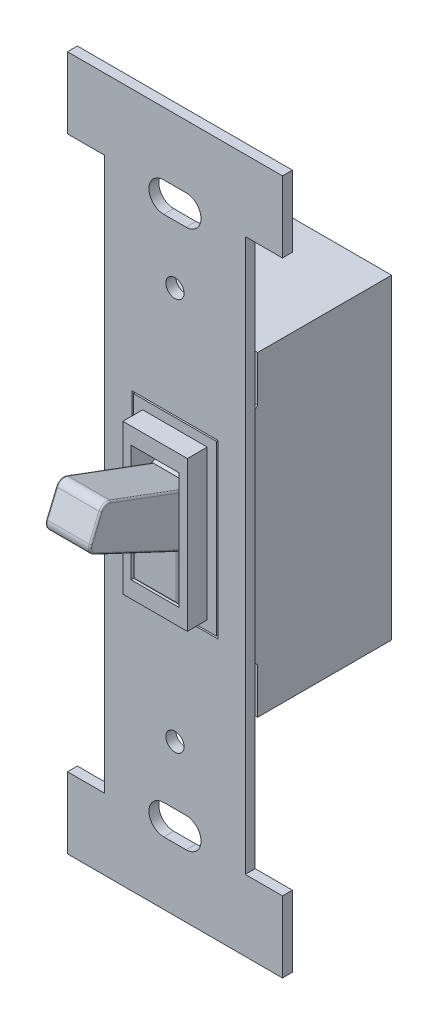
ISO-10303-21;
HEADER;
FILE_DESCRIPTION(('STEP AP214'),'2;1');
FILE_NAME('part.step','',(''),(''),'','','');
FILE_SCHEMA(('AUTOMOTIVE_DESIGN { 1 0 10303 214 1 1 1 1 }'));
ENDSEC;
DATA;
#1=APPLICATION_CONTEXT('core data for automotive mechanical design processes');
#2=APPLICATION_PROTOCOL_DEFINITION('international standard','automotive_design',2000,#1);
#3=PRODUCT_CONTEXT('',#1,'mechanical');
#4=PRODUCT('Part','Part','',(#3));
#5=PRODUCT_RELATED_PRODUCT_CATEGORY('part','',(#4));
#6=PRODUCT_DEFINITION_FORMATION('','',#4);
#7=PRODUCT_DEFINITION_CONTEXT('part definition',#1,'design');
#8=PRODUCT_DEFINITION('design','',#6,#7);
#9=PRODUCT_DEFINITION_SHAPE('','',#8);
#10=(LENGTH_UNIT() NAMED_UNIT(*) SI_UNIT(.MILLI.,.METRE.));
#11=(NAMED_UNIT(*) PLANE_ANGLE_UNIT() SI_UNIT($,.RADIAN.));
#12=(NAMED_UNIT(*) SI_UNIT($,.STERADIAN.) SOLID_ANGLE_UNIT());
#13=UNCERTAINTY_MEASURE_WITH_UNIT(LENGTH_MEASURE(1.E-05),#10,'distance_accuracy_value','');
#14=(GEOMETRIC_REPRESENTATION_CONTEXT(3) GLOBAL_UNCERTAINTY_ASSIGNED_CONTEXT((#13)) GLOBAL_UNIT_ASSIGNED_CONTEXT((#10,
#11,#12)) REPRESENTATION_CONTEXT('',''));
#15=CARTESIAN_POINT('',(0.,0.,0.));
#16=DIRECTION('',(0.,0.,1.));
#17=DIRECTION('',(1.,0.,0.));
#18=AXIS2_PLACEMENT_3D('',#15,#16,#17);
#19=CARTESIAN_POINT('',(0.,0.,1.524));
#20=DIRECTION('',(0.,0.,-1.));
#21=DIRECTION('',(-1.,0.,0.));
#22=AXIS2_PLACEMENT_3D('',#19,#20,#21);
#23=PLANE('',#22);
#24=CARTESIAN_POINT('',(0.,30.1625,1.524));
#25=DIRECTION('',(0.,0.,1.));
#26=DIRECTION('',(1.,0.,0.));
#27=AXIS2_PLACEMENT_3D('',#24,#25,#26);
#28=CIRCLE('',#27,1.397);
#29=CARTESIAN_POINT('',(1.397,30.1625,1.524));
#30=VERTEX_POINT('',#29);
#31=EDGE_CURVE('E860',#30,#30,#28,.T.);
#32=ORIENTED_EDGE('',*,*,#31,.F.);
#33=EDGE_LOOP('',(#32));
#34=FACE_BOUND('',#33,.T.);
#35=CARTESIAN_POINT('',(0.,-30.1625,1.524));
#36=DIRECTION('',(0.,0.,1.));
#37=DIRECTION('',(1.,0.,0.));
#38=AXIS2_PLACEMENT_3D('',#35,#36,#37);
#39=CIRCLE('',#38,1.397);
#40=CARTESIAN_POINT('',(1.397,-30.1625,1.524));
#41=VERTEX_POINT('',#40);
#42=EDGE_CURVE('E1597',#41,#41,#39,.T.);
#43=ORIENTED_EDGE('',*,*,#42,.F.);
#44=EDGE_LOOP('',(#43));
#45=FACE_BOUND('',#44,.T.);
#46=CARTESIAN_POINT('',(-1.7145,-41.402,1.524));
#47=DIRECTION('',(0.,0.,1.));
#48=DIRECTION('',(-1.,0.,0.));
#49=AXIS2_PLACEMENT_3D('',#46,#47,#48);
#50=CIRCLE('',#49,2.286);
#51=CARTESIAN_POINT('',(-1.7145,-39.116,1.524));
#52=VERTEX_POINT('',#51);
#53=CARTESIAN_POINT('',(-1.7145,-43.688,1.524));
#54=VERTEX_POINT('',#53);
#55=EDGE_CURVE('E646',#52,#54,#50,.T.);
#56=ORIENTED_EDGE('',*,*,#55,.F.);
#57=DIRECTION('',(-1.,0.,0.));
#58=VECTOR('',#57,1.);
#59=CARTESIAN_POINT('',(-1.7145,-39.116,1.524));
#60=LINE('',#59,#58);
#61=CARTESIAN_POINT('',(1.7145,-39.116,1.524));
#62=VERTEX_POINT('',#61);
#63=EDGE_CURVE('E654',#62,#52,#60,.T.);
#64=ORIENTED_EDGE('',*,*,#63,.F.);
#65=CARTESIAN_POINT('',(1.7145,-41.402,1.524));
#66=DIRECTION('',(0.,0.,1.));
#67=DIRECTION('',(-1.,0.,0.));
#68=AXIS2_PLACEMENT_3D('',#65,#66,#67);
#69=CIRCLE('',#68,2.286);
#70=CARTESIAN_POINT('',(1.7145,-43.688,1.524));
#71=VERTEX_POINT('',#70);
#72=EDGE_CURVE('E651',#71,#62,#69,.T.);
#73=ORIENTED_EDGE('',*,*,#72,.F.);
#74=DIRECTION('',(1.,0.,0.));
#75=VECTOR('',#74,1.);
#76=CARTESIAN_POINT('',(-1.7145,-43.688,1.524));
#77=LINE('',#76,#75);
#78=EDGE_CURVE('E648',#54,#71,#77,.T.);
#79=ORIENTED_EDGE('',*,*,#78,.F.);
#80=EDGE_LOOP('',(#56,#64,#73,#79));
#81=FACE_BOUND('',#80,.T.);
#82=DIRECTION('',(0.,-1.,0.));
#83=VECTOR('',#82,1.);
#84=CARTESIAN_POINT('',(-16.51,53.34,1.524));
#85=LINE('',#84,#83);
#86=CARTESIAN_POINT('',(-16.51,53.34,1.524));
#87=VERTEX_POINT('',#86);
#88=CARTESIAN_POINT('',(-16.51,42.418,1.524));
#89=VERTEX_POINT('',#88);
#90=EDGE_CURVE('E708',#87,#89,#85,.T.);
#91=ORIENTED_EDGE('',*,*,#90,.T.);
#92=DIRECTION('',(1.,0.,0.));
#93=VECTOR('',#92,1.);
#94=CARTESIAN_POINT('',(-10.795,42.418,1.524));
#95=LINE('',#94,#93);
#96=CARTESIAN_POINT('',(-10.795,42.418,1.524));
#97=VERTEX_POINT('',#96);
#98=EDGE_CURVE('E711',#89,#97,#95,.T.);
#99=ORIENTED_EDGE('',*,*,#98,.T.);
#100=DIRECTION('',(0.,-1.,0.));
#101=VECTOR('',#100,1.);
#102=CARTESIAN_POINT('',(-10.795,42.418,1.524));
#103=LINE('',#102,#101);
#104=CARTESIAN_POINT('',(-10.795,-42.418,1.524));
#105=VERTEX_POINT('',#104);
#106=EDGE_CURVE('E714',#97,#105,#103,.T.);
#107=ORIENTED_EDGE('',*,*,#106,.T.);
#108=DIRECTION('',(-1.,0.,0.));
#109=VECTOR('',#108,1.);
#110=CARTESIAN_POINT('',(-10.795,-42.418,1.524));
#111=LINE('',#110,#109);
#112=CARTESIAN_POINT('',(-16.51,-42.418,1.524));
#113=VERTEX_POINT('',#112);
#114=EDGE_CURVE('E716',#105,#113,#111,.T.);
#115=ORIENTED_EDGE('',*,*,#114,.T.);
#116=DIRECTION('',(0.,-1.,0.));
#117=VECTOR('',#116,1.);
#118=CARTESIAN_POINT('',(-16.51,-42.418,1.524));
#119=LINE('',#118,#117);
#120=CARTESIAN_POINT('',(-16.51,-53.34,1.524));
#121=VERTEX_POINT('',#120);
#122=EDGE_CURVE('E718',#113,#121,#119,.T.);
#123=ORIENTED_EDGE('',*,*,#122,.T.);
#124=DIRECTION('',(1.,0.,0.));
#125=VECTOR('',#124,1.);
#126=CARTESIAN_POINT('',(-16.51,-53.34,1.524));
#127=LINE('',#126,#125);
#128=CARTESIAN_POINT('',(16.51,-53.34,1.524));
#129=VERTEX_POINT('',#128);
#130=EDGE_CURVE('E720',#121,#129,#127,.T.);
#131=ORIENTED_EDGE('',*,*,#130,.T.);
#132=DIRECTION('',(0.,1.,0.));
#133=VECTOR('',#132,1.);
#134=CARTESIAN_POINT('',(16.51,-42.418,1.524));
#135=LINE('',#134,#133);
#136=CARTESIAN_POINT('',(16.51,-42.418,1.524));
#137=VERTEX_POINT('',#136);
#138=EDGE_CURVE('E722',#129,#137,#135,.T.);
#139=ORIENTED_EDGE('',*,*,#138,.T.);
#140=DIRECTION('',(-1.,0.,0.));
#141=VECTOR('',#140,1.);
#142=CARTESIAN_POINT('',(10.795,-42.418,1.524));
#143=LINE('',#142,#141);
#144=CARTESIAN_POINT('',(10.795,-42.418,1.524));
#145=VERTEX_POINT('',#144);
#146=EDGE_CURVE('E724',#137,#145,#143,.T.);
#147=ORIENTED_EDGE('',*,*,#146,.T.);
#148=DIRECTION('',(0.,1.,0.));
#149=VECTOR('',#148,1.);
#150=CARTESIAN_POINT('',(10.795,42.418,1.524));
#151=LINE('',#150,#149);
#152=CARTESIAN_POINT('',(10.795,42.418,1.524));
#153=VERTEX_POINT('',#152);
#154=EDGE_CURVE('E726',#145,#153,#151,.T.);
#155=ORIENTED_EDGE('',*,*,#154,.T.);
#156=DIRECTION('',(1.,0.,0.));
#157=VECTOR('',#156,1.);
#158=CARTESIAN_POINT('',(10.795,42.418,1.524));
#159=LINE('',#158,#157);
#160=CARTESIAN_POINT('',(16.51,42.418,1.524));
#161=VERTEX_POINT('',#160);
#162=EDGE_CURVE('E728',#153,#161,#159,.T.);
#163=ORIENTED_EDGE('',*,*,#162,.T.);
#164=DIRECTION('',(0.,1.,0.));
#165=VECTOR('',#164,1.);
#166=CARTESIAN_POINT('',(16.51,53.34,1.524));
#167=LINE('',#166,#165);
#168=CARTESIAN_POINT('',(16.51,53.34,1.524));
#169=VERTEX_POINT('',#168);
#170=EDGE_CURVE('E730',#161,#169,#167,.T.);
#171=ORIENTED_EDGE('',*,*,#170,.T.);
#172=DIRECTION('',(-1.,0.,0.));
#173=VECTOR('',#172,1.);
#174=CARTESIAN_POINT('',(-16.51,53.34,1.524));
#175=LINE('',#174,#173);
#176=EDGE_CURVE('E732',#169,#87,#175,.T.);
#177=ORIENTED_EDGE('',*,*,#176,.T.);
#178=EDGE_LOOP('',(#91,#99,#107,#115,#123,#131,#139,#147,#155,#163,#171,#177));
#179=FACE_BOUND('',#178,.T.);
#180=CARTESIAN_POINT('',(-1.7145,41.402,1.524));
#181=DIRECTION('',(0.,0.,1.));
#182=DIRECTION('',(1.,0.,0.));
#183=AXIS2_PLACEMENT_3D('',#180,#181,#182);
#184=CIRCLE('',#183,2.286);
#185=CARTESIAN_POINT('',(-1.7145,43.688,1.524));
#186=VERTEX_POINT('',#185);
#187=CARTESIAN_POINT('',(-1.7145,39.116,1.524));
#188=VERTEX_POINT('',#187);
#189=EDGE_CURVE('E677',#186,#188,#184,.T.);
#190=ORIENTED_EDGE('',*,*,#189,.F.);
#191=DIRECTION('',(-1.,0.,0.));
#192=VECTOR('',#191,1.);
#193=CARTESIAN_POINT('',(-1.7145,43.688,1.524));
#194=LINE('',#193,#192);
#195=CARTESIAN_POINT('',(1.7145,43.688,1.524));
#196=VERTEX_POINT('',#195);
#197=EDGE_CURVE('E685',#196,#186,#194,.T.);
#198=ORIENTED_EDGE('',*,*,#197,.F.);
#199=CARTESIAN_POINT('',(1.7145,41.402,1.524));
#200=DIRECTION('',(0.,0.,1.));
#201=DIRECTION('',(1.,0.,0.));
#202=AXIS2_PLACEMENT_3D('',#199,#200,#201);
#203=CIRCLE('',#202,2.286);
#204=CARTESIAN_POINT('',(1.7145,39.116,1.524));
#205=VERTEX_POINT('',#204);
#206=EDGE_CURVE('E682',#205,#196,#203,.T.);
#207=ORIENTED_EDGE('',*,*,#206,.F.);
#208=DIRECTION('',(1.,0.,0.));
#209=VECTOR('',#208,1.);
#210=CARTESIAN_POINT('',(-1.7145,39.116,1.524));
#211=LINE('',#210,#209);
#212=EDGE_CURVE('E679',#188,#205,#211,.T.);
#213=ORIENTED_EDGE('',*,*,#212,.F.);
#214=EDGE_LOOP('',(#190,#198,#207,#213));
#215=FACE_BOUND('',#214,.T.);
#216=DIRECTION('',(0.,-1.,0.));
#217=VECTOR('',#216,1.);
#218=CARTESIAN_POINT('',(-6.604,13.208,1.524));
#219=LINE('',#218,#217);
#220=CARTESIAN_POINT('',(-6.604,13.208,1.524));
#221=VERTEX_POINT('',#220);
#222=CARTESIAN_POINT('',(-6.604,-13.208,1.524));
#223=VERTEX_POINT('',#222);
#224=EDGE_CURVE('E616',#221,#223,#219,.T.);
#225=ORIENTED_EDGE('',*,*,#224,.F.);
#226=DIRECTION('',(-1.,0.,0.));
#227=VECTOR('',#226,1.);
#228=CARTESIAN_POINT('',(-6.604,13.208,1.524));
#229=LINE('',#228,#227);
#230=CARTESIAN_POINT('',(6.604,13.208,1.524));
#231=VERTEX_POINT('',#230);
#232=EDGE_CURVE('E624',#231,#221,#229,.T.);
#233=ORIENTED_EDGE('',*,*,#232,.F.);
#234=DIRECTION('',(0.,1.,0.));
#235=VECTOR('',#234,1.);
#236=CARTESIAN_POINT('',(6.604,13.208,1.524));
#237=LINE('',#236,#235);
#238=CARTESIAN_POINT('',(6.604,-13.208,1.524));
#239=VERTEX_POINT('',#238);
#240=EDGE_CURVE('E621',#239,#231,#237,.T.);
#241=ORIENTED_EDGE('',*,*,#240,.F.);
#242=DIRECTION('',(1.,0.,0.));
#243=VECTOR('',#242,1.);
#244=CARTESIAN_POINT('',(-6.604,-13.208,1.524));
#245=LINE('',#244,#243);
#246=EDGE_CURVE('E618',#223,#239,#245,.T.);
#247=ORIENTED_EDGE('',*,*,#246,.F.);
#248=EDGE_LOOP('',(#225,#233,#241,#247));
#249=FACE_BOUND('',#248,.T.);
#250=ADVANCED_FACE('F40',(#34,#45,#81,#179,#215,#249),#23,.F.);
#251=CARTESIAN_POINT('',(0.,0.,0.));
#252=DIRECTION('',(0.,0.,-1.));
#253=DIRECTION('',(-1.,0.,0.));
#254=AXIS2_PLACEMENT_3D('',#251,#252,#253);
#255=PLANE('',#254);
#256=CARTESIAN_POINT('',(0.,30.1625,0.));
#257=DIRECTION('',(0.,0.,-1.));
#258=DIRECTION('',(-1.,0.,0.));
#259=AXIS2_PLACEMENT_3D('',#256,#257,#258);
#260=CIRCLE('',#259,1.397);
#261=CARTESIAN_POINT('',(-1.397,30.1625,0.));
#262=VERTEX_POINT('',#261);
#263=EDGE_CURVE('E1594',#262,#262,#260,.F.);
#264=ORIENTED_EDGE('',*,*,#263,.T.);
#265=EDGE_LOOP('',(#264));
#266=FACE_BOUND('',#265,.T.);
#267=CARTESIAN_POINT('',(0.,-30.1625,0.));
#268=DIRECTION('',(0.,0.,-1.));
#269=DIRECTION('',(-1.,0.,0.));
#270=AXIS2_PLACEMENT_3D('',#267,#268,#269);
#271=CIRCLE('',#270,1.397);
#272=CARTESIAN_POINT('',(-1.397,-30.1625,0.));
#273=VERTEX_POINT('',#272);
#274=EDGE_CURVE('E1601',#273,#273,#271,.F.);
#275=ORIENTED_EDGE('',*,*,#274,.T.);
#276=EDGE_LOOP('',(#275));
#277=FACE_BOUND('',#276,.T.);
#278=DIRECTION('',(1.,0.,0.));
#279=VECTOR('',#278,1.);
#280=CARTESIAN_POINT('',(9.017,-15.113,0.));
#281=LINE('',#280,#279);
#282=CARTESIAN_POINT('',(-9.017,-15.113,0.));
#283=VERTEX_POINT('',#282);
#284=CARTESIAN_POINT('',(9.017,-15.113,0.));
#285=VERTEX_POINT('',#284);
#286=EDGE_CURVE('E603',#283,#285,#281,.T.);
#287=ORIENTED_EDGE('',*,*,#286,.T.);
#288=DIRECTION('',(0.,1.,0.));
#289=VECTOR('',#288,1.);
#290=CARTESIAN_POINT('',(9.017,17.272,0.));
#291=LINE('',#290,#289);
#292=CARTESIAN_POINT('',(9.017,15.113,0.));
#293=VERTEX_POINT('',#292);
#294=EDGE_CURVE('E562',#285,#293,#291,.T.);
#295=ORIENTED_EDGE('',*,*,#294,.T.);
#296=DIRECTION('',(-1.,0.,0.));
#297=VECTOR('',#296,1.);
#298=CARTESIAN_POINT('',(-9.017,15.113,0.));
#299=LINE('',#298,#297);
#300=CARTESIAN_POINT('',(-9.017,15.113,0.));
#301=VERTEX_POINT('',#300);
#302=EDGE_CURVE('E594',#293,#301,#299,.T.);
#303=ORIENTED_EDGE('',*,*,#302,.T.);
#304=DIRECTION('',(0.,-1.,0.));
#305=VECTOR('',#304,1.);
#306=CARTESIAN_POINT('',(-9.017,17.272,0.));
#307=LINE('',#306,#305);
#308=EDGE_CURVE('E559',#301,#283,#307,.T.);
#309=ORIENTED_EDGE('',*,*,#308,.T.);
#310=EDGE_LOOP('',(#287,#295,#303,#309));
#311=FACE_BOUND('',#310,.T.);
#312=DIRECTION('',(0.,-1.,0.));
#313=VECTOR('',#312,1.);
#314=CARTESIAN_POINT('',(-16.51,53.34,0.));
#315=LINE('',#314,#313);
#316=CARTESIAN_POINT('',(-16.51,53.34,0.));
#317=VERTEX_POINT('',#316);
#318=CARTESIAN_POINT('',(-16.51,42.418,0.));
#319=VERTEX_POINT('',#318);
#320=EDGE_CURVE('E707',#317,#319,#315,.T.);
#321=ORIENTED_EDGE('',*,*,#320,.F.);
#322=DIRECTION('',(-1.,0.,0.));
#323=VECTOR('',#322,1.);
#324=CARTESIAN_POINT('',(-16.51,53.34,0.));
#325=LINE('',#324,#323);
#326=CARTESIAN_POINT('',(16.51,53.34,0.));
#327=VERTEX_POINT('',#326);
#328=EDGE_CURVE('E712',#327,#317,#325,.T.);
#329=ORIENTED_EDGE('',*,*,#328,.F.);
#330=DIRECTION('',(0.,1.,0.));
#331=VECTOR('',#330,1.);
#332=CARTESIAN_POINT('',(16.51,53.34,0.));
#333=LINE('',#332,#331);
#334=CARTESIAN_POINT('',(16.51,42.418,0.));
#335=VERTEX_POINT('',#334);
#336=EDGE_CURVE('E755',#335,#327,#333,.T.);
#337=ORIENTED_EDGE('',*,*,#336,.F.);
#338=DIRECTION('',(1.,0.,0.));
#339=VECTOR('',#338,1.);
#340=CARTESIAN_POINT('',(10.795,42.418,0.));
#341=LINE('',#340,#339);
#342=CARTESIAN_POINT('',(10.795,42.418,0.));
#343=VERTEX_POINT('',#342);
#344=EDGE_CURVE('E753',#343,#335,#341,.T.);
#345=ORIENTED_EDGE('',*,*,#344,.F.);
#346=DIRECTION('',(0.,1.,0.));
#347=VECTOR('',#346,1.);
#348=CARTESIAN_POINT('',(10.795,42.418,0.));
#349=LINE('',#348,#347);
#350=CARTESIAN_POINT('',(10.795,-42.418,0.));
#351=VERTEX_POINT('',#350);
#352=EDGE_CURVE('E751',#351,#343,#349,.T.);
#353=ORIENTED_EDGE('',*,*,#352,.F.);
#354=DIRECTION('',(-1.,0.,0.));
#355=VECTOR('',#354,1.);
#356=CARTESIAN_POINT('',(10.795,-42.418,0.));
#357=LINE('',#356,#355);
#358=CARTESIAN_POINT('',(16.51,-42.418,0.));
#359=VERTEX_POINT('',#358);
#360=EDGE_CURVE('E749',#359,#351,#357,.T.);
#361=ORIENTED_EDGE('',*,*,#360,.F.);
#362=DIRECTION('',(0.,1.,0.));
#363=VECTOR('',#362,1.);
#364=CARTESIAN_POINT('',(16.51,-42.418,0.));
#365=LINE('',#364,#363);
#366=CARTESIAN_POINT('',(16.51,-53.34,0.));
#367=VERTEX_POINT('',#366);
#368=EDGE_CURVE('E747',#367,#359,#365,.T.);
#369=ORIENTED_EDGE('',*,*,#368,.F.);
#370=DIRECTION('',(1.,0.,0.));
#371=VECTOR('',#370,1.);
#372=CARTESIAN_POINT('',(-16.51,-53.34,0.));
#373=LINE('',#372,#371);
#374=CARTESIAN_POINT('',(-16.51,-53.34,0.));
#375=VERTEX_POINT('',#374);
#376=EDGE_CURVE('E745',#375,#367,#373,.T.);
#377=ORIENTED_EDGE('',*,*,#376,.F.);
#378=DIRECTION('',(0.,-1.,0.));
#379=VECTOR('',#378,1.);
#380=CARTESIAN_POINT('',(-16.51,-42.418,0.));
#381=LINE('',#380,#379);
#382=CARTESIAN_POINT('',(-16.51,-42.418,0.));
#383=VERTEX_POINT('',#382);
#384=EDGE_CURVE('E743',#383,#375,#381,.T.);
#385=ORIENTED_EDGE('',*,*,#384,.F.);
#386=DIRECTION('',(-1.,0.,0.));
#387=VECTOR('',#386,1.);
#388=CARTESIAN_POINT('',(-10.795,-42.418,0.));
#389=LINE('',#388,#387);
#390=CARTESIAN_POINT('',(-10.795,-42.418,0.));
#391=VERTEX_POINT('',#390);
#392=EDGE_CURVE('E741',#391,#383,#389,.T.);
#393=ORIENTED_EDGE('',*,*,#392,.F.);
#394=DIRECTION('',(0.,-1.,0.));
#395=VECTOR('',#394,1.);
#396=CARTESIAN_POINT('',(-10.795,42.418,0.));
#397=LINE('',#396,#395);
#398=CARTESIAN_POINT('',(-10.795,42.418,0.));
#399=VERTEX_POINT('',#398);
#400=EDGE_CURVE('E739',#399,#391,#397,.T.);
#401=ORIENTED_EDGE('',*,*,#400,.F.);
#402=DIRECTION('',(1.,0.,0.));
#403=VECTOR('',#402,1.);
#404=CARTESIAN_POINT('',(-10.795,42.418,0.));
#405=LINE('',#404,#403);
#406=EDGE_CURVE('E737',#319,#399,#405,.T.);
#407=ORIENTED_EDGE('',*,*,#406,.F.);
#408=EDGE_LOOP('',(#321,#329,#337,#345,#353,#361,#369,#377,#385,#393,#401,#407));
#409=FACE_BOUND('',#408,.T.);
#410=DIRECTION('',(-1.,0.,0.));
#411=VECTOR('',#410,1.);
#412=CARTESIAN_POINT('',(-1.7145,43.688,0.));
#413=LINE('',#412,#411);
#414=CARTESIAN_POINT('',(1.7145,43.688,0.));
#415=VERTEX_POINT('',#414);
#416=CARTESIAN_POINT('',(-1.7145,43.688,0.));
#417=VERTEX_POINT('',#416);
#418=EDGE_CURVE('E680',#415,#417,#413,.T.);
#419=ORIENTED_EDGE('',*,*,#418,.T.);
#420=CARTESIAN_POINT('',(-1.7145,41.402,0.));
#421=DIRECTION('',(0.,0.,1.));
#422=DIRECTION('',(1.,0.,0.));
#423=AXIS2_PLACEMENT_3D('',#420,#421,#422);
#424=CIRCLE('',#423,2.286);
#425=CARTESIAN_POINT('',(-1.7145,39.116,0.));
#426=VERTEX_POINT('',#425);
#427=EDGE_CURVE('E676',#417,#426,#424,.T.);
#428=ORIENTED_EDGE('',*,*,#427,.T.);
#429=DIRECTION('',(1.,0.,0.));
#430=VECTOR('',#429,1.);
#431=CARTESIAN_POINT('',(-1.7145,39.116,0.));
#432=LINE('',#431,#430);
#433=CARTESIAN_POINT('',(1.7145,39.116,0.));
#434=VERTEX_POINT('',#433);
#435=EDGE_CURVE('E690',#426,#434,#432,.T.);
#436=ORIENTED_EDGE('',*,*,#435,.T.);
#437=CARTESIAN_POINT('',(1.7145,41.402,0.));
#438=DIRECTION('',(0.,0.,1.));
#439=DIRECTION('',(1.,0.,0.));
#440=AXIS2_PLACEMENT_3D('',#437,#438,#439);
#441=CIRCLE('',#440,2.286);
#442=EDGE_CURVE('E693',#434,#415,#441,.T.);
#443=ORIENTED_EDGE('',*,*,#442,.T.);
#444=EDGE_LOOP('',(#419,#428,#436,#443));
#445=FACE_BOUND('',#444,.T.);
#446=DIRECTION('',(-1.,0.,0.));
#447=VECTOR('',#446,1.);
#448=CARTESIAN_POINT('',(-1.7145,-39.116,0.));
#449=LINE('',#448,#447);
#450=CARTESIAN_POINT('',(1.7145,-39.116,0.));
#451=VERTEX_POINT('',#450);
#452=CARTESIAN_POINT('',(-1.7145,-39.116,0.));
#453=VERTEX_POINT('',#452);
#454=EDGE_CURVE('E649',#451,#453,#449,.T.);
#455=ORIENTED_EDGE('',*,*,#454,.T.);
#456=CARTESIAN_POINT('',(-1.7145,-41.402,0.));
#457=DIRECTION('',(0.,0.,1.));
#458=DIRECTION('',(-1.,0.,0.));
#459=AXIS2_PLACEMENT_3D('',#456,#457,#458);
#460=CIRCLE('',#459,2.286);
#461=CARTESIAN_POINT('',(-1.7145,-43.688,0.));
#462=VERTEX_POINT('',#461);
#463=EDGE_CURVE('E645',#453,#462,#460,.T.);
#464=ORIENTED_EDGE('',*,*,#463,.T.);
#465=DIRECTION('',(1.,0.,0.));
#466=VECTOR('',#465,1.);
#467=CARTESIAN_POINT('',(-1.7145,-43.688,0.));
#468=LINE('',#467,#466);
#469=CARTESIAN_POINT('',(1.7145,-43.688,0.));
#470=VERTEX_POINT('',#469);
#471=EDGE_CURVE('E659',#462,#470,#468,.T.);
#472=ORIENTED_EDGE('',*,*,#471,.T.);
#473=CARTESIAN_POINT('',(1.7145,-41.402,0.));
#474=DIRECTION('',(0.,0.,1.));
#475=DIRECTION('',(-1.,0.,0.));
#476=AXIS2_PLACEMENT_3D('',#473,#474,#475);
#477=CIRCLE('',#476,2.286);
#478=EDGE_CURVE('E662',#470,#451,#477,.T.);
#479=ORIENTED_EDGE('',*,*,#478,.T.);
#480=EDGE_LOOP('',(#455,#464,#472,#479));
#481=FACE_BOUND('',#480,.T.);
#482=ADVANCED_FACE('F975',(#266,#277,#311,#409,#445,#481),#255,.T.);
#483=CARTESIAN_POINT('',(-16.51,53.34,1.524));
#484=DIRECTION('',(1.,0.,0.));
#485=DIRECTION('',(0.,0.,-1.));
#486=AXIS2_PLACEMENT_3D('',#483,#484,#485);
#487=PLANE('',#486);
#488=ORIENTED_EDGE('',*,*,#320,.T.);
#489=DIRECTION('',(0.,0.,-1.));
#490=VECTOR('',#489,1.);
#491=CARTESIAN_POINT('',(-16.51,42.418,1.524));
#492=LINE('',#491,#490);
#493=EDGE_CURVE('E790',#89,#319,#492,.T.);
#494=ORIENTED_EDGE('',*,*,#493,.F.);
#495=ORIENTED_EDGE('',*,*,#90,.F.);
#496=DIRECTION('',(0.,0.,-1.));
#497=VECTOR('',#496,1.);
#498=CARTESIAN_POINT('',(-16.51,53.34,1.524));
#499=LINE('',#498,#497);
#500=EDGE_CURVE('E734',#87,#317,#499,.T.);
#501=ORIENTED_EDGE('',*,*,#500,.T.);
#502=EDGE_LOOP('',(#488,#494,#495,#501));
#503=FACE_BOUND('',#502,.T.);
#504=ADVANCED_FACE('F981',(#503),#487,.F.);
#505=CARTESIAN_POINT('',(-10.795,42.418,1.524));
#506=DIRECTION('',(0.,1.,0.));
#507=DIRECTION('',(0.,0.,1.));
#508=AXIS2_PLACEMENT_3D('',#505,#506,#507);
#509=PLANE('',#508);
#510=ORIENTED_EDGE('',*,*,#406,.T.);
#511=DIRECTION('',(0.,0.,-1.));
#512=VECTOR('',#511,1.);
#513=CARTESIAN_POINT('',(-10.795,42.418,1.524));
#514=LINE('',#513,#512);
#515=EDGE_CURVE('E787',#97,#399,#514,.T.);
#516=ORIENTED_EDGE('',*,*,#515,.F.);
#517=ORIENTED_EDGE('',*,*,#98,.F.);
#518=ORIENTED_EDGE('',*,*,#493,.T.);
#519=EDGE_LOOP('',(#510,#516,#517,#518));
#520=FACE_BOUND('',#519,.T.);
#521=ADVANCED_FACE('F1029',(#520),#509,.F.);
#522=CARTESIAN_POINT('',(-10.795,42.418,1.524));
#523=DIRECTION('',(1.,0.,0.));
#524=DIRECTION('',(0.,0.,-1.));
#525=AXIS2_PLACEMENT_3D('',#522,#523,#524);
#526=PLANE('',#525);
#527=ORIENTED_EDGE('',*,*,#400,.T.);
#528=DIRECTION('',(0.,0.,-1.));
#529=VECTOR('',#528,1.);
#530=CARTESIAN_POINT('',(-10.795,-42.418,1.524));
#531=LINE('',#530,#529);
#532=EDGE_CURVE('E784',#105,#391,#531,.T.);
#533=ORIENTED_EDGE('',*,*,#532,.F.);
#534=ORIENTED_EDGE('',*,*,#106,.F.);
#535=ORIENTED_EDGE('',*,*,#515,.T.);
#536=EDGE_LOOP('',(#527,#533,#534,#535));
#537=FACE_BOUND('',#536,.T.);
#538=ADVANCED_FACE('F1025',(#537),#526,.F.);
#539=CARTESIAN_POINT('',(-10.795,-42.418,1.524));
#540=DIRECTION('',(0.,-1.,0.));
#541=DIRECTION('',(0.,0.,-1.));
#542=AXIS2_PLACEMENT_3D('',#539,#540,#541);
#543=PLANE('',#542);
#544=ORIENTED_EDGE('',*,*,#392,.T.);
#545=DIRECTION('',(0.,0.,-1.));
#546=VECTOR('',#545,1.);
#547=CARTESIAN_POINT('',(-16.51,-42.418,1.524));
#548=LINE('',#547,#546);
#549=EDGE_CURVE('E781',#113,#383,#548,.T.);
#550=ORIENTED_EDGE('',*,*,#549,.F.);
#551=ORIENTED_EDGE('',*,*,#114,.F.);
#552=ORIENTED_EDGE('',*,*,#532,.T.);
#553=EDGE_LOOP('',(#544,#550,#551,#552));
#554=FACE_BOUND('',#553,.T.);
#555=ADVANCED_FACE('F1021',(#554),#543,.F.);
#556=CARTESIAN_POINT('',(-16.51,-42.418,1.524));
#557=DIRECTION('',(1.,0.,0.));
#558=DIRECTION('',(0.,0.,-1.));
#559=AXIS2_PLACEMENT_3D('',#556,#557,#558);
#560=PLANE('',#559);
#561=ORIENTED_EDGE('',*,*,#384,.T.);
#562=DIRECTION('',(0.,0.,-1.));
#563=VECTOR('',#562,1.);
#564=CARTESIAN_POINT('',(-16.51,-53.34,1.524));
#565=LINE('',#564,#563);
#566=EDGE_CURVE('E778',#121,#375,#565,.T.);
#567=ORIENTED_EDGE('',*,*,#566,.F.);
#568=ORIENTED_EDGE('',*,*,#122,.F.);
#569=ORIENTED_EDGE('',*,*,#549,.T.);
#570=EDGE_LOOP('',(#561,#567,#568,#569));
#571=FACE_BOUND('',#570,.T.);
#572=ADVANCED_FACE('F1017',(#571),#560,.F.);
#573=CARTESIAN_POINT('',(-16.51,-53.34,1.524));
#574=DIRECTION('',(0.,1.,0.));
#575=DIRECTION('',(0.,0.,1.));
#576=AXIS2_PLACEMENT_3D('',#573,#574,#575);
#577=PLANE('',#576);
#578=ORIENTED_EDGE('',*,*,#376,.T.);
#579=DIRECTION('',(0.,0.,-1.));
#580=VECTOR('',#579,1.);
#581=CARTESIAN_POINT('',(16.51,-53.34,1.524));
#582=LINE('',#581,#580);
#583=EDGE_CURVE('E775',#129,#367,#582,.T.);
#584=ORIENTED_EDGE('',*,*,#583,.F.);
#585=ORIENTED_EDGE('',*,*,#130,.F.);
#586=ORIENTED_EDGE('',*,*,#566,.T.);
#587=EDGE_LOOP('',(#578,#584,#585,#586));
#588=FACE_BOUND('',#587,.T.);
#589=ADVANCED_FACE('F1013',(#588),#577,.F.);
#590=CARTESIAN_POINT('',(16.51,-42.418,1.524));
#591=DIRECTION('',(-1.,0.,0.));
#592=DIRECTION('',(0.,0.,1.));
#593=AXIS2_PLACEMENT_3D('',#590,#591,#592);
#594=PLANE('',#593);
#595=ORIENTED_EDGE('',*,*,#368,.T.);
#596=DIRECTION('',(0.,0.,-1.));
#597=VECTOR('',#596,1.);
#598=CARTESIAN_POINT('',(16.51,-42.418,1.524));
#599=LINE('',#598,#597);
#600=EDGE_CURVE('E772',#137,#359,#599,.T.);
#601=ORIENTED_EDGE('',*,*,#600,.F.);
#602=ORIENTED_EDGE('',*,*,#138,.F.);
#603=ORIENTED_EDGE('',*,*,#583,.T.);
#604=EDGE_LOOP('',(#595,#601,#602,#603));
#605=FACE_BOUND('',#604,.T.);
#606=ADVANCED_FACE('F1009',(#605),#594,.F.);
#607=CARTESIAN_POINT('',(10.795,-42.418,1.524));
#608=DIRECTION('',(0.,-1.,0.));
#609=DIRECTION('',(0.,0.,-1.));
#610=AXIS2_PLACEMENT_3D('',#607,#608,#609);
#611=PLANE('',#610);
#612=ORIENTED_EDGE('',*,*,#360,.T.);
#613=DIRECTION('',(0.,0.,-1.));
#614=VECTOR('',#613,1.);
#615=CARTESIAN_POINT('',(10.795,-42.418,1.524));
#616=LINE('',#615,#614);
#617=EDGE_CURVE('E769',#145,#351,#616,.T.);
#618=ORIENTED_EDGE('',*,*,#617,.F.);
#619=ORIENTED_EDGE('',*,*,#146,.F.);
#620=ORIENTED_EDGE('',*,*,#600,.T.);
#621=EDGE_LOOP('',(#612,#618,#619,#620));
#622=FACE_BOUND('',#621,.T.);
#623=ADVANCED_FACE('F1005',(#622),#611,.F.);
#624=CARTESIAN_POINT('',(10.795,42.418,1.524));
#625=DIRECTION('',(-1.,0.,0.));
#626=DIRECTION('',(0.,0.,1.));
#627=AXIS2_PLACEMENT_3D('',#624,#625,#626);
#628=PLANE('',#627);
#629=ORIENTED_EDGE('',*,*,#352,.T.);
#630=DIRECTION('',(0.,0.,-1.));
#631=VECTOR('',#630,1.);
#632=CARTESIAN_POINT('',(10.795,42.418,1.524));
#633=LINE('',#632,#631);
#634=EDGE_CURVE('E766',#153,#343,#633,.T.);
#635=ORIENTED_EDGE('',*,*,#634,.F.);
#636=ORIENTED_EDGE('',*,*,#154,.F.);
#637=ORIENTED_EDGE('',*,*,#617,.T.);
#638=EDGE_LOOP('',(#629,#635,#636,#637));
#639=FACE_BOUND('',#638,.T.);
#640=ADVANCED_FACE('F1001',(#639),#628,.F.);
#641=CARTESIAN_POINT('',(10.795,42.418,1.524));
#642=DIRECTION('',(0.,1.,0.));
#643=DIRECTION('',(0.,0.,1.));
#644=AXIS2_PLACEMENT_3D('',#641,#642,#643);
#645=PLANE('',#644);
#646=ORIENTED_EDGE('',*,*,#344,.T.);
#647=DIRECTION('',(0.,0.,-1.));
#648=VECTOR('',#647,1.);
#649=CARTESIAN_POINT('',(16.51,42.418,1.524));
#650=LINE('',#649,#648);
#651=EDGE_CURVE('E763',#161,#335,#650,.T.);
#652=ORIENTED_EDGE('',*,*,#651,.F.);
#653=ORIENTED_EDGE('',*,*,#162,.F.);
#654=ORIENTED_EDGE('',*,*,#634,.T.);
#655=EDGE_LOOP('',(#646,#652,#653,#654));
#656=FACE_BOUND('',#655,.T.);
#657=ADVANCED_FACE('F997',(#656),#645,.F.);
#658=CARTESIAN_POINT('',(16.51,53.34,1.524));
#659=DIRECTION('',(-1.,0.,0.));
#660=DIRECTION('',(0.,0.,1.));
#661=AXIS2_PLACEMENT_3D('',#658,#659,#660);
#662=PLANE('',#661);
#663=ORIENTED_EDGE('',*,*,#336,.T.);
#664=DIRECTION('',(0.,0.,-1.));
#665=VECTOR('',#664,1.);
#666=CARTESIAN_POINT('',(16.51,53.34,1.524));
#667=LINE('',#666,#665);
#668=EDGE_CURVE('E760',#169,#327,#667,.T.);
#669=ORIENTED_EDGE('',*,*,#668,.F.);
#670=ORIENTED_EDGE('',*,*,#170,.F.);
#671=ORIENTED_EDGE('',*,*,#651,.T.);
#672=EDGE_LOOP('',(#663,#669,#670,#671));
#673=FACE_BOUND('',#672,.T.);
#674=ADVANCED_FACE('F993',(#673),#662,.F.);
#675=CARTESIAN_POINT('',(-16.51,53.34,1.524));
#676=DIRECTION('',(0.,-1.,0.));
#677=DIRECTION('',(0.,0.,-1.));
#678=AXIS2_PLACEMENT_3D('',#675,#676,#677);
#679=PLANE('',#678);
#680=ORIENTED_EDGE('',*,*,#328,.T.);
#681=ORIENTED_EDGE('',*,*,#500,.F.);
#682=ORIENTED_EDGE('',*,*,#176,.F.);
#683=ORIENTED_EDGE('',*,*,#668,.T.);
#684=EDGE_LOOP('',(#680,#681,#682,#683));
#685=FACE_BOUND('',#684,.T.);
#686=ADVANCED_FACE('F990',(#685),#679,.F.);
#687=CARTESIAN_POINT('',(-1.7145,41.402,1.524));
#688=DIRECTION('',(0.,0.,-1.));
#689=DIRECTION('',(-1.,0.,0.));
#690=AXIS2_PLACEMENT_3D('',#687,#688,#689);
#691=CYLINDRICAL_SURFACE('',#690,2.286);
#692=ORIENTED_EDGE('',*,*,#427,.F.);
#693=DIRECTION('',(0.,0.,-1.));
#694=VECTOR('',#693,1.);
#695=CARTESIAN_POINT('',(-1.7145,43.688,1.524));
#696=LINE('',#695,#694);
#697=EDGE_CURVE('E687',#186,#417,#696,.T.);
#698=ORIENTED_EDGE('',*,*,#697,.F.);
#699=ORIENTED_EDGE('',*,*,#189,.T.);
#700=DIRECTION('',(0.,0.,-1.));
#701=VECTOR('',#700,1.);
#702=CARTESIAN_POINT('',(-1.7145,39.116,1.524));
#703=LINE('',#702,#701);
#704=EDGE_CURVE('E704',#188,#426,#703,.T.);
#705=ORIENTED_EDGE('',*,*,#704,.T.);
#706=EDGE_LOOP('',(#692,#698,#699,#705));
#707=FACE_BOUND('',#706,.T.);
#708=ADVANCED_FACE('F987',(#707),#691,.F.);
#709=CARTESIAN_POINT('',(-1.7145,39.116,1.524));
#710=DIRECTION('',(0.,1.,0.));
#711=DIRECTION('',(0.,0.,1.));
#712=AXIS2_PLACEMENT_3D('',#709,#710,#711);
#713=PLANE('',#712);
#714=ORIENTED_EDGE('',*,*,#435,.F.);
#715=ORIENTED_EDGE('',*,*,#704,.F.);
#716=ORIENTED_EDGE('',*,*,#212,.T.);
#717=DIRECTION('',(0.,0.,-1.));
#718=VECTOR('',#717,1.);
#719=CARTESIAN_POINT('',(1.7145,39.116,1.524));
#720=LINE('',#719,#718);
#721=EDGE_CURVE('E702',#205,#434,#720,.T.);
#722=ORIENTED_EDGE('',*,*,#721,.T.);
#723=EDGE_LOOP('',(#714,#715,#716,#722));
#724=FACE_BOUND('',#723,.T.);
#725=ADVANCED_FACE('F1469',(#724),#713,.T.);
#726=CARTESIAN_POINT('',(1.7145,41.402,1.524));
#727=DIRECTION('',(0.,0.,-1.));
#728=DIRECTION('',(-1.,0.,0.));
#729=AXIS2_PLACEMENT_3D('',#726,#727,#728);
#730=CYLINDRICAL_SURFACE('',#729,2.286);
#731=ORIENTED_EDGE('',*,*,#442,.F.);
#732=ORIENTED_EDGE('',*,*,#721,.F.);
#733=ORIENTED_EDGE('',*,*,#206,.T.);
#734=DIRECTION('',(0.,0.,-1.));
#735=VECTOR('',#734,1.);
#736=CARTESIAN_POINT('',(1.7145,43.688,1.524));
#737=LINE('',#736,#735);
#738=EDGE_CURVE('E700',#196,#415,#737,.T.);
#739=ORIENTED_EDGE('',*,*,#738,.T.);
#740=EDGE_LOOP('',(#731,#732,#733,#739));
#741=FACE_BOUND('',#740,.T.);
#742=ADVANCED_FACE('F1459',(#741),#730,.F.);
#743=CARTESIAN_POINT('',(-1.7145,43.688,1.524));
#744=DIRECTION('',(0.,-1.,0.));
#745=DIRECTION('',(0.,0.,-1.));
#746=AXIS2_PLACEMENT_3D('',#743,#744,#745);
#747=PLANE('',#746);
#748=ORIENTED_EDGE('',*,*,#418,.F.);
#749=ORIENTED_EDGE('',*,*,#738,.F.);
#750=ORIENTED_EDGE('',*,*,#197,.T.);
#751=ORIENTED_EDGE('',*,*,#697,.T.);
#752=EDGE_LOOP('',(#748,#749,#750,#751));
#753=FACE_BOUND('',#752,.T.);
#754=ADVANCED_FACE('F1449',(#753),#747,.T.);
#755=CARTESIAN_POINT('',(-1.7145,-41.402,1.524));
#756=DIRECTION('',(0.,0.,-1.));
#757=DIRECTION('',(-1.,0.,0.));
#758=AXIS2_PLACEMENT_3D('',#755,#756,#757);
#759=CYLINDRICAL_SURFACE('',#758,2.286);
#760=ORIENTED_EDGE('',*,*,#463,.F.);
#761=DIRECTION('',(0.,0.,-1.));
#762=VECTOR('',#761,1.);
#763=CARTESIAN_POINT('',(-1.7145,-39.116,1.524));
#764=LINE('',#763,#762);
#765=EDGE_CURVE('E656',#52,#453,#764,.T.);
#766=ORIENTED_EDGE('',*,*,#765,.F.);
#767=ORIENTED_EDGE('',*,*,#55,.T.);
#768=DIRECTION('',(0.,0.,-1.));
#769=VECTOR('',#768,1.);
#770=CARTESIAN_POINT('',(-1.7145,-43.688,1.524));
#771=LINE('',#770,#769);
#772=EDGE_CURVE('E673',#54,#462,#771,.T.);
#773=ORIENTED_EDGE('',*,*,#772,.T.);
#774=EDGE_LOOP('',(#760,#766,#767,#773));
#775=FACE_BOUND('',#774,.T.);
#776=ADVANCED_FACE('F1439',(#775),#759,.F.);
#777=CARTESIAN_POINT('',(-1.7145,-43.688,1.524));
#778=DIRECTION('',(0.,1.,0.));
#779=DIRECTION('',(0.,0.,1.));
#780=AXIS2_PLACEMENT_3D('',#777,#778,#779);
#781=PLANE('',#780);
#782=ORIENTED_EDGE('',*,*,#471,.F.);
#783=ORIENTED_EDGE('',*,*,#772,.F.);
#784=ORIENTED_EDGE('',*,*,#78,.T.);
#785=DIRECTION('',(0.,0.,-1.));
#786=VECTOR('',#785,1.);
#787=CARTESIAN_POINT('',(1.7145,-43.688,1.524));
#788=LINE('',#787,#786);
#789=EDGE_CURVE('E671',#71,#470,#788,.T.);
#790=ORIENTED_EDGE('',*,*,#789,.T.);
#791=EDGE_LOOP('',(#782,#783,#784,#790));
#792=FACE_BOUND('',#791,.T.);
#793=ADVANCED_FACE('F1429',(#792),#781,.T.);
#794=CARTESIAN_POINT('',(1.7145,-41.402,1.524));
#795=DIRECTION('',(0.,0.,-1.));
#796=DIRECTION('',(-1.,0.,0.));
#797=AXIS2_PLACEMENT_3D('',#794,#795,#796);
#798=CYLINDRICAL_SURFACE('',#797,2.286);
#799=ORIENTED_EDGE('',*,*,#478,.F.);
#800=ORIENTED_EDGE('',*,*,#789,.F.);
#801=ORIENTED_EDGE('',*,*,#72,.T.);
#802=DIRECTION('',(0.,0.,-1.));
#803=VECTOR('',#802,1.);
#804=CARTESIAN_POINT('',(1.7145,-39.116,1.524));
#805=LINE('',#804,#803);
#806=EDGE_CURVE('E669',#62,#451,#805,.T.);
#807=ORIENTED_EDGE('',*,*,#806,.T.);
#808=EDGE_LOOP('',(#799,#800,#801,#807));
#809=FACE_BOUND('',#808,.T.);
#810=ADVANCED_FACE('F1419',(#809),#798,.F.);
#811=CARTESIAN_POINT('',(-1.7145,-39.116,1.524));
#812=DIRECTION('',(0.,-1.,0.));
#813=DIRECTION('',(0.,0.,-1.));
#814=AXIS2_PLACEMENT_3D('',#811,#812,#813);
#815=PLANE('',#814);
#816=ORIENTED_EDGE('',*,*,#454,.F.);
#817=ORIENTED_EDGE('',*,*,#806,.F.);
#818=ORIENTED_EDGE('',*,*,#63,.T.);
#819=ORIENTED_EDGE('',*,*,#765,.T.);
#820=EDGE_LOOP('',(#816,#817,#818,#819));
#821=FACE_BOUND('',#820,.T.);
#822=ADVANCED_FACE('F1409',(#821),#815,.T.);
#823=CARTESIAN_POINT('',(-6.604,13.208,1.524));
#824=DIRECTION('',(1.,0.,0.));
#825=DIRECTION('',(0.,0.,-1.));
#826=AXIS2_PLACEMENT_3D('',#823,#824,#825);
#827=PLANE('',#826);
#828=DIRECTION('',(0.,-1.,0.));
#829=VECTOR('',#828,1.);
#830=CARTESIAN_POINT('',(-6.604,13.208,0.));
#831=LINE('',#830,#829);
#832=CARTESIAN_POINT('',(-6.604,13.208,0.));
#833=VERTEX_POINT('',#832);
#834=CARTESIAN_POINT('',(-6.604,-13.208,0.));
#835=VERTEX_POINT('',#834);
#836=EDGE_CURVE('E615',#833,#835,#831,.T.);
#837=ORIENTED_EDGE('',*,*,#836,.F.);
#838=DIRECTION('',(0.,0.,-1.));
#839=VECTOR('',#838,1.);
#840=CARTESIAN_POINT('',(-6.604,13.208,1.524));
#841=LINE('',#840,#839);
#842=EDGE_CURVE('E626',#221,#833,#841,.T.);
#843=ORIENTED_EDGE('',*,*,#842,.F.);
#844=ORIENTED_EDGE('',*,*,#224,.T.);
#845=DIRECTION('',(0.,0.,-1.));
#846=VECTOR('',#845,1.);
#847=CARTESIAN_POINT('',(-6.604,-13.208,1.524));
#848=LINE('',#847,#846);
#849=EDGE_CURVE('E642',#223,#835,#848,.T.);
#850=ORIENTED_EDGE('',*,*,#849,.T.);
#851=EDGE_LOOP('',(#837,#843,#844,#850));
#852=FACE_BOUND('',#851,.T.);
#853=ADVANCED_FACE('F1399',(#852),#827,.T.);
#854=CARTESIAN_POINT('',(-6.604,-13.208,1.524));
#855=DIRECTION('',(0.,1.,0.));
#856=DIRECTION('',(0.,0.,1.));
#857=AXIS2_PLACEMENT_3D('',#854,#855,#856);
#858=PLANE('',#857);
#859=DIRECTION('',(1.,0.,0.));
#860=VECTOR('',#859,1.);
#861=CARTESIAN_POINT('',(-6.604,-13.208,0.));
#862=LINE('',#861,#860);
#863=CARTESIAN_POINT('',(6.604,-13.208,0.));
#864=VERTEX_POINT('',#863);
#865=EDGE_CURVE('E629',#835,#864,#862,.T.);
#866=ORIENTED_EDGE('',*,*,#865,.F.);
#867=ORIENTED_EDGE('',*,*,#849,.F.);
#868=ORIENTED_EDGE('',*,*,#246,.T.);
#869=DIRECTION('',(0.,0.,-1.));
#870=VECTOR('',#869,1.);
#871=CARTESIAN_POINT('',(6.604,-13.208,1.524));
#872=LINE('',#871,#870);
#873=EDGE_CURVE('E640',#239,#864,#872,.T.);
#874=ORIENTED_EDGE('',*,*,#873,.T.);
#875=EDGE_LOOP('',(#866,#867,#868,#874));
#876=FACE_BOUND('',#875,.T.);
#877=ADVANCED_FACE('F1389',(#876),#858,.T.);
#878=CARTESIAN_POINT('',(6.604,13.208,1.524));
#879=DIRECTION('',(-1.,0.,0.));
#880=DIRECTION('',(0.,0.,1.));
#881=AXIS2_PLACEMENT_3D('',#878,#879,#880);
#882=PLANE('',#881);
#883=DIRECTION('',(0.,1.,0.));
#884=VECTOR('',#883,1.);
#885=CARTESIAN_POINT('',(6.604,13.208,0.));
#886=LINE('',#885,#884);
#887=CARTESIAN_POINT('',(6.604,13.208,0.));
#888=VERTEX_POINT('',#887);
#889=EDGE_CURVE('E632',#864,#888,#886,.T.);
#890=ORIENTED_EDGE('',*,*,#889,.F.);
#891=ORIENTED_EDGE('',*,*,#873,.F.);
#892=ORIENTED_EDGE('',*,*,#240,.T.);
#893=DIRECTION('',(0.,0.,-1.));
#894=VECTOR('',#893,1.);
#895=CARTESIAN_POINT('',(6.604,13.208,1.524));
#896=LINE('',#895,#894);
#897=EDGE_CURVE('E638',#231,#888,#896,.T.);
#898=ORIENTED_EDGE('',*,*,#897,.T.);
#899=EDGE_LOOP('',(#890,#891,#892,#898));
#900=FACE_BOUND('',#899,.T.);
#901=ADVANCED_FACE('F1379',(#900),#882,.T.);
#902=CARTESIAN_POINT('',(-6.604,13.208,1.524));
#903=DIRECTION('',(0.,-1.,0.));
#904=DIRECTION('',(0.,0.,-1.));
#905=AXIS2_PLACEMENT_3D('',#902,#903,#904);
#906=PLANE('',#905);
#907=DIRECTION('',(-1.,0.,0.));
#908=VECTOR('',#907,1.);
#909=CARTESIAN_POINT('',(-6.604,13.208,0.));
#910=LINE('',#909,#908);
#911=EDGE_CURVE('E619',#888,#833,#910,.T.);
#912=ORIENTED_EDGE('',*,*,#911,.F.);
#913=ORIENTED_EDGE('',*,*,#897,.F.);
#914=ORIENTED_EDGE('',*,*,#232,.T.);
#915=ORIENTED_EDGE('',*,*,#842,.T.);
#916=EDGE_LOOP('',(#912,#913,#914,#915));
#917=FACE_BOUND('',#916,.T.);
#918=ADVANCED_FACE('F1370',(#917),#906,.T.);
#919=CARTESIAN_POINT('',(0.,0.,1.524));
#920=DIRECTION('',(0.,0.,1.));
#921=DIRECTION('',(1.,0.,0.));
#922=AXIS2_PLACEMENT_3D('',#919,#920,#921);
#923=PLANE('',#922);
#924=DIRECTION('',(0.,-1.,0.));
#925=VECTOR('',#924,1.);
#926=CARTESIAN_POINT('',(-4.953,11.4935,1.524));
#927=LINE('',#926,#925);
#928=CARTESIAN_POINT('',(-4.953,11.4935,1.524));
#929=VERTEX_POINT('',#928);
#930=CARTESIAN_POINT('',(-4.953,-11.4935,1.524));
#931=VERTEX_POINT('',#930);
#932=EDGE_CURVE('E489',#929,#931,#927,.T.);
#933=ORIENTED_EDGE('',*,*,#932,.F.);
#934=DIRECTION('',(-1.,0.,0.));
#935=VECTOR('',#934,1.);
#936=CARTESIAN_POINT('',(-4.953,11.4935,1.524));
#937=LINE('',#936,#935);
#938=CARTESIAN_POINT('',(4.953,11.4935,1.524));
#939=VERTEX_POINT('',#938);
#940=EDGE_CURVE('E494',#939,#929,#937,.T.);
#941=ORIENTED_EDGE('',*,*,#940,.F.);
#942=DIRECTION('',(0.,1.,0.));
#943=VECTOR('',#942,1.);
#944=CARTESIAN_POINT('',(4.953,11.4935,1.524));
#945=LINE('',#944,#943);
#946=CARTESIAN_POINT('',(4.953,-11.4935,1.524));
#947=VERTEX_POINT('',#946);
#948=EDGE_CURVE('E506',#947,#939,#945,.T.);
#949=ORIENTED_EDGE('',*,*,#948,.F.);
#950=DIRECTION('',(1.,0.,0.));
#951=VECTOR('',#950,1.);
#952=CARTESIAN_POINT('',(-4.953,-11.4935,1.524));
#953=LINE('',#952,#951);
#954=EDGE_CURVE('E503',#931,#947,#953,.T.);
#955=ORIENTED_EDGE('',*,*,#954,.F.);
#956=EDGE_LOOP('',(#933,#941,#949,#955));
#957=FACE_BOUND('',#956,.T.);
#958=DIRECTION('',(0.,-1.,0.));
#959=VECTOR('',#958,1.);
#960=CARTESIAN_POINT('',(-6.35,12.954,1.524));
#961=LINE('',#960,#959);
#962=CARTESIAN_POINT('',(-6.35,12.954,1.524));
#963=VERTEX_POINT('',#962);
#964=CARTESIAN_POINT('',(-6.35,-12.954,1.524));
#965=VERTEX_POINT('',#964);
#966=EDGE_CURVE('E523',#963,#965,#961,.T.);
#967=ORIENTED_EDGE('',*,*,#966,.T.);
#968=DIRECTION('',(1.,0.,0.));
#969=VECTOR('',#968,1.);
#970=CARTESIAN_POINT('',(-6.35,-12.954,1.524));
#971=LINE('',#970,#969);
#972=CARTESIAN_POINT('',(6.35,-12.954,1.524));
#973=VERTEX_POINT('',#972);
#974=EDGE_CURVE('E526',#965,#973,#971,.T.);
#975=ORIENTED_EDGE('',*,*,#974,.T.);
#976=DIRECTION('',(0.,1.,0.));
#977=VECTOR('',#976,1.);
#978=CARTESIAN_POINT('',(6.35,12.954,1.524));
#979=LINE('',#978,#977);
#980=CARTESIAN_POINT('',(6.35,12.954,1.524));
#981=VERTEX_POINT('',#980);
#982=EDGE_CURVE('E529',#973,#981,#979,.T.);
#983=ORIENTED_EDGE('',*,*,#982,.T.);
#984=DIRECTION('',(-1.,0.,0.));
#985=VECTOR('',#984,1.);
#986=CARTESIAN_POINT('',(-6.35,12.954,1.524));
#987=LINE('',#986,#985);
#988=EDGE_CURVE('E531',#981,#963,#987,.T.);
#989=ORIENTED_EDGE('',*,*,#988,.T.);
#990=EDGE_LOOP('',(#967,#975,#983,#989));
#991=FACE_BOUND('',#990,.T.);
#992=ADVANCED_FACE('F1361',(#957,#991),#923,.T.);
#993=CARTESIAN_POINT('',(-6.35,12.954,1.524));
#994=DIRECTION('',(0.,-1.,0.));
#995=DIRECTION('',(0.,0.,-1.));
#996=AXIS2_PLACEMENT_3D('',#993,#994,#995);
#997=PLANE('',#996);
#998=DIRECTION('',(-1.,0.,0.));
#999=VECTOR('',#998,1.);
#1000=CARTESIAN_POINT('',(-6.35,12.954,0.));
#1001=LINE('',#1000,#999);
#1002=CARTESIAN_POINT('',(6.35,12.954,0.));
#1003=VERTEX_POINT('',#1002);
#1004=CARTESIAN_POINT('',(-6.35,12.954,0.));
#1005=VERTEX_POINT('',#1004);
#1006=EDGE_CURVE('E527',#1003,#1005,#1001,.T.);
#1007=ORIENTED_EDGE('',*,*,#1006,.T.);
#1008=DIRECTION('',(0.,0.,-1.));
#1009=VECTOR('',#1008,1.);
#1010=CARTESIAN_POINT('',(-6.35,12.954,1.524));
#1011=LINE('',#1010,#1009);
#1012=EDGE_CURVE('E533',#963,#1005,#1011,.T.);
#1013=ORIENTED_EDGE('',*,*,#1012,.F.);
#1014=ORIENTED_EDGE('',*,*,#988,.F.);
#1015=DIRECTION('',(0.,0.,-1.));
#1016=VECTOR('',#1015,1.);
#1017=CARTESIAN_POINT('',(6.35,12.954,1.524));
#1018=LINE('',#1017,#1016);
#1019=EDGE_CURVE('E546',#981,#1003,#1018,.T.);
#1020=ORIENTED_EDGE('',*,*,#1019,.T.);
#1021=EDGE_LOOP('',(#1007,#1013,#1014,#1020));
#1022=FACE_BOUND('',#1021,.T.);
#1023=ADVANCED_FACE('F1351',(#1022),#997,.F.);
#1024=CARTESIAN_POINT('',(6.35,12.954,1.524));
#1025=DIRECTION('',(-1.,0.,0.));
#1026=DIRECTION('',(0.,0.,1.));
#1027=AXIS2_PLACEMENT_3D('',#1024,#1025,#1026);
#1028=PLANE('',#1027);
#1029=DIRECTION('',(0.,1.,0.));
#1030=VECTOR('',#1029,1.);
#1031=CARTESIAN_POINT('',(6.35,12.954,0.));
#1032=LINE('',#1031,#1030);
#1033=CARTESIAN_POINT('',(6.35,-12.954,0.));
#1034=VERTEX_POINT('',#1033);
#1035=EDGE_CURVE('E539',#1034,#1003,#1032,.T.);
#1036=ORIENTED_EDGE('',*,*,#1035,.T.);
#1037=ORIENTED_EDGE('',*,*,#1019,.F.);
#1038=ORIENTED_EDGE('',*,*,#982,.F.);
#1039=DIRECTION('',(0.,0.,-1.));
#1040=VECTOR('',#1039,1.);
#1041=CARTESIAN_POINT('',(6.35,-12.954,1.524));
#1042=LINE('',#1041,#1040);
#1043=EDGE_CURVE('E549',#973,#1034,#1042,.T.);
#1044=ORIENTED_EDGE('',*,*,#1043,.T.);
#1045=EDGE_LOOP('',(#1036,#1037,#1038,#1044));
#1046=FACE_BOUND('',#1045,.T.);
#1047=ADVANCED_FACE('F1341',(#1046),#1028,.F.);
#1048=CARTESIAN_POINT('',(-6.35,-12.954,1.524));
#1049=DIRECTION('',(0.,1.,0.));
#1050=DIRECTION('',(0.,0.,1.));
#1051=AXIS2_PLACEMENT_3D('',#1048,#1049,#1050);
#1052=PLANE('',#1051);
#1053=DIRECTION('',(1.,0.,0.));
#1054=VECTOR('',#1053,1.);
#1055=CARTESIAN_POINT('',(-6.35,-12.954,0.));
#1056=LINE('',#1055,#1054);
#1057=CARTESIAN_POINT('',(-6.35,-12.954,0.));
#1058=VERTEX_POINT('',#1057);
#1059=EDGE_CURVE('E536',#1058,#1034,#1056,.T.);
#1060=ORIENTED_EDGE('',*,*,#1059,.T.);
#1061=ORIENTED_EDGE('',*,*,#1043,.F.);
#1062=ORIENTED_EDGE('',*,*,#974,.F.);
#1063=DIRECTION('',(0.,0.,-1.));
#1064=VECTOR('',#1063,1.);
#1065=CARTESIAN_POINT('',(-6.35,-12.954,1.524));
#1066=LINE('',#1065,#1064);
#1067=EDGE_CURVE('E552',#965,#1058,#1066,.T.);
#1068=ORIENTED_EDGE('',*,*,#1067,.T.);
#1069=EDGE_LOOP('',(#1060,#1061,#1062,#1068));
#1070=FACE_BOUND('',#1069,.T.);
#1071=ADVANCED_FACE('F1331',(#1070),#1052,.F.);
#1072=CARTESIAN_POINT('',(-6.35,12.954,1.524));
#1073=DIRECTION('',(1.,0.,0.));
#1074=DIRECTION('',(0.,0.,-1.));
#1075=AXIS2_PLACEMENT_3D('',#1072,#1073,#1074);
#1076=PLANE('',#1075);
#1077=DIRECTION('',(0.,-1.,0.));
#1078=VECTOR('',#1077,1.);
#1079=CARTESIAN_POINT('',(-6.35,12.954,0.));
#1080=LINE('',#1079,#1078);
#1081=EDGE_CURVE('E522',#1005,#1058,#1080,.T.);
#1082=ORIENTED_EDGE('',*,*,#1081,.T.);
#1083=ORIENTED_EDGE('',*,*,#1067,.F.);
#1084=ORIENTED_EDGE('',*,*,#966,.F.);
#1085=ORIENTED_EDGE('',*,*,#1012,.T.);
#1086=EDGE_LOOP('',(#1082,#1083,#1084,#1085));
#1087=FACE_BOUND('',#1086,.T.);
#1088=ADVANCED_FACE('F1322',(#1087),#1076,.F.);
#1089=CARTESIAN_POINT('',(0.,0.,0.));
#1090=DIRECTION('',(0.,0.,1.));
#1091=DIRECTION('',(1.,0.,0.));
#1092=AXIS2_PLACEMENT_3D('',#1089,#1090,#1091);
#1093=PLANE('',#1092);
#1094=ORIENTED_EDGE('',*,*,#911,.T.);
#1095=ORIENTED_EDGE('',*,*,#836,.T.);
#1096=ORIENTED_EDGE('',*,*,#865,.T.);
#1097=ORIENTED_EDGE('',*,*,#889,.T.);
#1098=EDGE_LOOP('',(#1094,#1095,#1096,#1097));
#1099=FACE_BOUND('',#1098,.T.);
#1100=ORIENTED_EDGE('',*,*,#1081,.F.);
#1101=ORIENTED_EDGE('',*,*,#1006,.F.);
#1102=ORIENTED_EDGE('',*,*,#1035,.F.);
#1103=ORIENTED_EDGE('',*,*,#1059,.F.);
#1104=EDGE_LOOP('',(#1100,#1101,#1102,#1103));
#1105=FACE_BOUND('',#1104,.T.);
#1106=ADVANCED_FACE('F1313',(#1099,#1105),#1093,.T.);
#1107=CARTESIAN_POINT('',(0.,0.,-2.159));
#1108=DIRECTION('',(0.,0.,1.));
#1109=DIRECTION('',(1.,0.,0.));
#1110=AXIS2_PLACEMENT_3D('',#1107,#1108,#1109);
#1111=PLANE('',#1110);
#1112=DIRECTION('',(-1.,0.,0.));
#1113=VECTOR('',#1112,1.);
#1114=CARTESIAN_POINT('',(-9.017,17.272,-2.159));
#1115=LINE('',#1114,#1113);
#1116=CARTESIAN_POINT('',(9.017,17.272,-2.159));
#1117=VERTEX_POINT('',#1116);
#1118=CARTESIAN_POINT('',(-9.017,17.272,-2.159));
#1119=VERTEX_POINT('',#1118);
#1120=EDGE_CURVE('E556',#1117,#1119,#1115,.T.);
#1121=ORIENTED_EDGE('',*,*,#1120,.F.);
#1122=DIRECTION('',(0.,1.,0.));
#1123=VECTOR('',#1122,1.);
#1124=CARTESIAN_POINT('',(9.017,24.257,-2.159));
#1125=LINE('',#1124,#1123);
#1126=CARTESIAN_POINT('',(9.017,24.257,-2.159));
#1127=VERTEX_POINT('',#1126);
#1128=EDGE_CURVE('E586',#1117,#1127,#1125,.T.);
#1129=ORIENTED_EDGE('',*,*,#1128,.T.);
#1130=DIRECTION('',(-1.,0.,0.));
#1131=VECTOR('',#1130,1.);
#1132=CARTESIAN_POINT('',(-9.017,24.257,-2.159));
#1133=LINE('',#1132,#1131);
#1134=CARTESIAN_POINT('',(-9.017,24.257,-2.159));
#1135=VERTEX_POINT('',#1134);
#1136=EDGE_CURVE('E570',#1127,#1135,#1133,.T.);
#1137=ORIENTED_EDGE('',*,*,#1136,.T.);
#1138=DIRECTION('',(0.,-1.,0.));
#1139=VECTOR('',#1138,1.);
#1140=CARTESIAN_POINT('',(-9.017,24.257,-2.159));
#1141=LINE('',#1140,#1139);
#1142=EDGE_CURVE('E580',#1135,#1119,#1141,.T.);
#1143=ORIENTED_EDGE('',*,*,#1142,.T.);
#1144=EDGE_LOOP('',(#1121,#1129,#1137,#1143));
#1145=FACE_BOUND('',#1144,.T.);
#1146=ADVANCED_FACE('F1254',(#1145),#1111,.T.);
#1147=CARTESIAN_POINT('',(-9.017,24.257,-22.733));
#1148=DIRECTION('',(-1.,0.,0.));
#1149=DIRECTION('',(0.,0.,1.));
#1150=AXIS2_PLACEMENT_3D('',#1147,#1148,#1149);
#1151=PLANE('',#1150);
#1152=CARTESIAN_POINT('',(-9.017,-17.272,-2.159));
#1153=VERTEX_POINT('',#1152);
#1154=CARTESIAN_POINT('',(-9.017,-24.257,-2.159));
#1155=VERTEX_POINT('',#1154);
#1156=EDGE_CURVE('E564',#1153,#1155,#1141,.T.);
#1157=ORIENTED_EDGE('',*,*,#1156,.F.);
#1158=DIRECTION('',(0.,0.707106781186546,0.707106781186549));
#1159=VECTOR('',#1158,1.);
#1160=CARTESIAN_POINT('',(-9.017,-6.79450000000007,8.31849999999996));
#1161=LINE('',#1160,#1159);
#1162=EDGE_CURVE('E612',#1153,#283,#1161,.T.);
#1163=ORIENTED_EDGE('',*,*,#1162,.T.);
#1164=ORIENTED_EDGE('',*,*,#308,.F.);
#1165=DIRECTION('',(0.,0.707106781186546,-0.707106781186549));
#1166=VECTOR('',#1165,1.);
#1167=CARTESIAN_POINT('',(-9.017,31.0515,-15.9385));
#1168=LINE('',#1167,#1166);
#1169=EDGE_CURVE('E610',#301,#1119,#1168,.T.);
#1170=ORIENTED_EDGE('',*,*,#1169,.T.);
#1171=ORIENTED_EDGE('',*,*,#1142,.F.);
#1172=DIRECTION('',(0.,0.,1.));
#1173=VECTOR('',#1172,1.);
#1174=CARTESIAN_POINT('',(-9.017,24.257,-22.733));
#1175=LINE('',#1174,#1173);
#1176=CARTESIAN_POINT('',(-9.017,24.257,-22.733));
#1177=VERTEX_POINT('',#1176);
#1178=EDGE_CURVE('E592',#1177,#1135,#1175,.T.);
#1179=ORIENTED_EDGE('',*,*,#1178,.F.);
#1180=DIRECTION('',(0.,-1.,0.));
#1181=VECTOR('',#1180,1.);
#1182=CARTESIAN_POINT('',(-9.017,24.257,-22.733));
#1183=LINE('',#1182,#1181);
#1184=CARTESIAN_POINT('',(-9.017,-24.257,-22.733));
#1185=VERTEX_POINT('',#1184);
#1186=EDGE_CURVE('E566',#1177,#1185,#1183,.T.);
#1187=ORIENTED_EDGE('',*,*,#1186,.T.);
#1188=DIRECTION('',(0.,0.,1.));
#1189=VECTOR('',#1188,1.);
#1190=CARTESIAN_POINT('',(-9.017,-24.257,-22.733));
#1191=LINE('',#1190,#1189);
#1192=EDGE_CURVE('E579',#1185,#1155,#1191,.T.);
#1193=ORIENTED_EDGE('',*,*,#1192,.T.);
#1194=EDGE_LOOP('',(#1157,#1163,#1164,#1170,#1171,#1179,#1187,#1193));
#1195=FACE_BOUND('',#1194,.T.);
#1196=ADVANCED_FACE('F1293',(#1195),#1151,.T.);
#1197=CARTESIAN_POINT('',(-9.017,24.257,-22.733));
#1198=DIRECTION('',(0.,1.,0.));
#1199=DIRECTION('',(0.,0.,1.));
#1200=AXIS2_PLACEMENT_3D('',#1197,#1198,#1199);
#1201=PLANE('',#1200);
#1202=ORIENTED_EDGE('',*,*,#1136,.F.);
#1203=DIRECTION('',(0.,0.,1.));
#1204=VECTOR('',#1203,1.);
#1205=CARTESIAN_POINT('',(9.017,24.257,-22.733));
#1206=LINE('',#1205,#1204);
#1207=CARTESIAN_POINT('',(9.017,24.257,-22.733));
#1208=VERTEX_POINT('',#1207);
#1209=EDGE_CURVE('E595',#1208,#1127,#1206,.T.);
#1210=ORIENTED_EDGE('',*,*,#1209,.F.);
#1211=DIRECTION('',(-1.,0.,0.));
#1212=VECTOR('',#1211,1.);
#1213=CARTESIAN_POINT('',(-9.017,24.257,-22.733));
#1214=LINE('',#1213,#1212);
#1215=EDGE_CURVE('E576',#1208,#1177,#1214,.T.);
#1216=ORIENTED_EDGE('',*,*,#1215,.T.);
#1217=ORIENTED_EDGE('',*,*,#1178,.T.);
#1218=EDGE_LOOP('',(#1202,#1210,#1216,#1217));
#1219=FACE_BOUND('',#1218,.T.);
#1220=ADVANCED_FACE('F1283',(#1219),#1201,.T.);
#1221=CARTESIAN_POINT('',(9.017,24.257,-22.733));
#1222=DIRECTION('',(1.,0.,0.));
#1223=DIRECTION('',(0.,0.,-1.));
#1224=AXIS2_PLACEMENT_3D('',#1221,#1222,#1223);
#1225=PLANE('',#1224);
#1226=ORIENTED_EDGE('',*,*,#294,.F.);
#1227=DIRECTION('',(0.,-0.707106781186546,-0.707106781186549));
#1228=VECTOR('',#1227,1.);
#1229=CARTESIAN_POINT('',(9.017,-6.79450000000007,8.31849999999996));
#1230=LINE('',#1229,#1228);
#1231=CARTESIAN_POINT('',(9.017,-17.272,-2.159));
#1232=VERTEX_POINT('',#1231);
#1233=EDGE_CURVE('E608',#285,#1232,#1230,.T.);
#1234=ORIENTED_EDGE('',*,*,#1233,.T.);
#1235=CARTESIAN_POINT('',(9.017,-24.257,-2.159));
#1236=VERTEX_POINT('',#1235);
#1237=EDGE_CURVE('E587',#1236,#1232,#1125,.T.);
#1238=ORIENTED_EDGE('',*,*,#1237,.F.);
#1239=DIRECTION('',(0.,0.,1.));
#1240=VECTOR('',#1239,1.);
#1241=CARTESIAN_POINT('',(9.017,-24.257,-22.733));
#1242=LINE('',#1241,#1240);
#1243=CARTESIAN_POINT('',(9.017,-24.257,-22.733));
#1244=VERTEX_POINT('',#1243);
#1245=EDGE_CURVE('E598',#1244,#1236,#1242,.T.);
#1246=ORIENTED_EDGE('',*,*,#1245,.F.);
#1247=DIRECTION('',(0.,1.,0.));
#1248=VECTOR('',#1247,1.);
#1249=CARTESIAN_POINT('',(9.017,24.257,-22.733));
#1250=LINE('',#1249,#1248);
#1251=EDGE_CURVE('E573',#1244,#1208,#1250,.T.);
#1252=ORIENTED_EDGE('',*,*,#1251,.T.);
#1253=ORIENTED_EDGE('',*,*,#1209,.T.);
#1254=ORIENTED_EDGE('',*,*,#1128,.F.);
#1255=DIRECTION('',(0.,-0.707106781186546,0.707106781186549));
#1256=VECTOR('',#1255,1.);
#1257=CARTESIAN_POINT('',(9.017,31.0515,-15.9385));
#1258=LINE('',#1257,#1256);
#1259=EDGE_CURVE('E605',#1117,#293,#1258,.T.);
#1260=ORIENTED_EDGE('',*,*,#1259,.T.);
#1261=EDGE_LOOP('',(#1226,#1234,#1238,#1246,#1252,#1253,#1254,#1260));
#1262=FACE_BOUND('',#1261,.T.);
#1263=ADVANCED_FACE('F1272',(#1262),#1225,.T.);
#1264=CARTESIAN_POINT('',(-9.017,-24.257,-22.733));
#1265=DIRECTION('',(0.,-1.,0.));
#1266=DIRECTION('',(0.,0.,-1.));
#1267=AXIS2_PLACEMENT_3D('',#1264,#1265,#1266);
#1268=PLANE('',#1267);
#1269=DIRECTION('',(1.,0.,0.));
#1270=VECTOR('',#1269,1.);
#1271=CARTESIAN_POINT('',(-9.017,-24.257,-2.159));
#1272=LINE('',#1271,#1270);
#1273=EDGE_CURVE('E583',#1155,#1236,#1272,.T.);
#1274=ORIENTED_EDGE('',*,*,#1273,.F.);
#1275=ORIENTED_EDGE('',*,*,#1192,.F.);
#1276=DIRECTION('',(1.,0.,0.));
#1277=VECTOR('',#1276,1.);
#1278=CARTESIAN_POINT('',(-9.017,-24.257,-22.733));
#1279=LINE('',#1278,#1277);
#1280=EDGE_CURVE('E569',#1185,#1244,#1279,.T.);
#1281=ORIENTED_EDGE('',*,*,#1280,.T.);
#1282=ORIENTED_EDGE('',*,*,#1245,.T.);
#1283=EDGE_LOOP('',(#1274,#1275,#1281,#1282));
#1284=FACE_BOUND('',#1283,.T.);
#1285=ADVANCED_FACE('F1262',(#1284),#1268,.T.);
#1286=CARTESIAN_POINT('',(0.,0.,-22.733));
#1287=DIRECTION('',(0.,0.,1.));
#1288=DIRECTION('',(1.,0.,0.));
#1289=AXIS2_PLACEMENT_3D('',#1286,#1287,#1288);
#1290=PLANE('',#1289);
#1291=ORIENTED_EDGE('',*,*,#1186,.F.);
#1292=ORIENTED_EDGE('',*,*,#1215,.F.);
#1293=ORIENTED_EDGE('',*,*,#1251,.F.);
#1294=ORIENTED_EDGE('',*,*,#1280,.F.);
#1295=EDGE_LOOP('',(#1291,#1292,#1293,#1294));
#1296=FACE_BOUND('',#1295,.T.);
#1297=ADVANCED_FACE('F1251',(#1296),#1290,.F.);
#1298=DIRECTION('',(1.,0.,0.));
#1299=VECTOR('',#1298,1.);
#1300=CARTESIAN_POINT('',(-9.017,-17.272,-2.159));
#1301=LINE('',#1300,#1299);
#1302=EDGE_CURVE('E555',#1153,#1232,#1301,.T.);
#1303=ORIENTED_EDGE('',*,*,#1302,.F.);
#1304=ORIENTED_EDGE('',*,*,#1156,.T.);
#1305=ORIENTED_EDGE('',*,*,#1273,.T.);
#1306=ORIENTED_EDGE('',*,*,#1237,.T.);
#1307=EDGE_LOOP('',(#1303,#1304,#1305,#1306));
#1308=FACE_BOUND('',#1307,.T.);
#1309=ADVANCED_FACE('F1240',(#1308),#1111,.T.);
#1310=CARTESIAN_POINT('',(0.,-15.113,0.));
#1311=DIRECTION('',(0.,-0.707106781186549,0.707106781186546));
#1312=DIRECTION('',(-1.,0.,0.));
#1313=AXIS2_PLACEMENT_3D('',#1310,#1311,#1312);
#1314=PLANE('',#1313);
#1315=ORIENTED_EDGE('',*,*,#1162,.F.);
#1316=ORIENTED_EDGE('',*,*,#1302,.T.);
#1317=ORIENTED_EDGE('',*,*,#1233,.F.);
#1318=ORIENTED_EDGE('',*,*,#286,.F.);
#1319=EDGE_LOOP('',(#1315,#1316,#1317,#1318));
#1320=FACE_BOUND('',#1319,.T.);
#1321=ADVANCED_FACE('F1229',(#1320),#1314,.T.);
#1322=CARTESIAN_POINT('',(0.,15.113,0.));
#1323=DIRECTION('',(0.,0.707106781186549,0.707106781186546));
#1324=DIRECTION('',(1.,0.,0.));
#1325=AXIS2_PLACEMENT_3D('',#1322,#1323,#1324);
#1326=PLANE('',#1325);
#1327=ORIENTED_EDGE('',*,*,#1259,.F.);
#1328=ORIENTED_EDGE('',*,*,#1120,.T.);
#1329=ORIENTED_EDGE('',*,*,#1169,.F.);
#1330=ORIENTED_EDGE('',*,*,#302,.F.);
#1331=EDGE_LOOP('',(#1327,#1328,#1329,#1330));
#1332=FACE_BOUND('',#1331,.T.);
#1333=ADVANCED_FACE('F1218',(#1332),#1326,.T.);
#1334=CARTESIAN_POINT('',(-4.953,11.4935,4.572));
#1335=DIRECTION('',(1.,0.,0.));
#1336=DIRECTION('',(0.,0.,-1.));
#1337=AXIS2_PLACEMENT_3D('',#1334,#1335,#1336);
#1338=PLANE('',#1337);
#1339=ORIENTED_EDGE('',*,*,#932,.T.);
#1340=DIRECTION('',(0.,0.,-1.));
#1341=VECTOR('',#1340,1.);
#1342=CARTESIAN_POINT('',(-4.953,-11.4935,4.572));
#1343=LINE('',#1342,#1341);
#1344=CARTESIAN_POINT('',(-4.953,-11.4935,4.572));
#1345=VERTEX_POINT('',#1344);
#1346=EDGE_CURVE('E519',#1345,#931,#1343,.T.);
#1347=ORIENTED_EDGE('',*,*,#1346,.F.);
#1348=DIRECTION('',(0.,-1.,0.));
#1349=VECTOR('',#1348,1.);
#1350=CARTESIAN_POINT('',(-4.953,11.4935,4.572));
#1351=LINE('',#1350,#1349);
#1352=CARTESIAN_POINT('',(-4.953,11.4935,4.572));
#1353=VERTEX_POINT('',#1352);
#1354=EDGE_CURVE('E490',#1353,#1345,#1351,.T.);
#1355=ORIENTED_EDGE('',*,*,#1354,.F.);
#1356=DIRECTION('',(0.,0.,-1.));
#1357=VECTOR('',#1356,1.);
#1358=CARTESIAN_POINT('',(-4.953,11.4935,4.572));
#1359=LINE('',#1358,#1357);
#1360=EDGE_CURVE('E500',#1353,#929,#1359,.T.);
#1361=ORIENTED_EDGE('',*,*,#1360,.T.);
#1362=EDGE_LOOP('',(#1339,#1347,#1355,#1361));
#1363=FACE_BOUND('',#1362,.T.);
#1364=ADVANCED_FACE('F1208',(#1363),#1338,.F.);
#1365=CARTESIAN_POINT('',(-4.953,-11.4935,4.572));
#1366=DIRECTION('',(0.,1.,0.));
#1367=DIRECTION('',(0.,0.,1.));
#1368=AXIS2_PLACEMENT_3D('',#1365,#1366,#1367);
#1369=PLANE('',#1368);
#1370=ORIENTED_EDGE('',*,*,#954,.T.);
#1371=DIRECTION('',(0.,0.,-1.));
#1372=VECTOR('',#1371,1.);
#1373=CARTESIAN_POINT('',(4.953,-11.4935,4.572));
#1374=LINE('',#1373,#1372);
#1375=CARTESIAN_POINT('',(4.953,-11.4935,4.572));
#1376=VERTEX_POINT('',#1375);
#1377=EDGE_CURVE('E516',#1376,#947,#1374,.T.);
#1378=ORIENTED_EDGE('',*,*,#1377,.F.);
#1379=DIRECTION('',(1.,0.,0.));
#1380=VECTOR('',#1379,1.);
#1381=CARTESIAN_POINT('',(-4.953,-11.4935,4.572));
#1382=LINE('',#1381,#1380);
#1383=EDGE_CURVE('E493',#1345,#1376,#1382,.T.);
#1384=ORIENTED_EDGE('',*,*,#1383,.F.);
#1385=ORIENTED_EDGE('',*,*,#1346,.T.);
#1386=EDGE_LOOP('',(#1370,#1378,#1384,#1385));
#1387=FACE_BOUND('',#1386,.T.);
#1388=ADVANCED_FACE('F1198',(#1387),#1369,.F.);
#1389=CARTESIAN_POINT('',(4.953,11.4935,4.572));
#1390=DIRECTION('',(-1.,0.,0.));
#1391=DIRECTION('',(0.,0.,1.));
#1392=AXIS2_PLACEMENT_3D('',#1389,#1390,#1391);
#1393=PLANE('',#1392);
#1394=ORIENTED_EDGE('',*,*,#948,.T.);
#1395=DIRECTION('',(0.,0.,-1.));
#1396=VECTOR('',#1395,1.);
#1397=CARTESIAN_POINT('',(4.953,11.4935,4.572));
#1398=LINE('',#1397,#1396);
#1399=CARTESIAN_POINT('',(4.953,11.4935,4.572));
#1400=VERTEX_POINT('',#1399);
#1401=EDGE_CURVE('E513',#1400,#939,#1398,.T.);
#1402=ORIENTED_EDGE('',*,*,#1401,.F.);
#1403=DIRECTION('',(0.,1.,0.));
#1404=VECTOR('',#1403,1.);
#1405=CARTESIAN_POINT('',(4.953,11.4935,4.572));
#1406=LINE('',#1405,#1404);
#1407=EDGE_CURVE('E496',#1376,#1400,#1406,.T.);
#1408=ORIENTED_EDGE('',*,*,#1407,.F.);
#1409=ORIENTED_EDGE('',*,*,#1377,.T.);
#1410=EDGE_LOOP('',(#1394,#1402,#1408,#1409));
#1411=FACE_BOUND('',#1410,.T.);
#1412=ADVANCED_FACE('F1188',(#1411),#1393,.F.);
#1413=CARTESIAN_POINT('',(-4.953,11.4935,4.572));
#1414=DIRECTION('',(0.,-1.,0.));
#1415=DIRECTION('',(0.,0.,-1.));
#1416=AXIS2_PLACEMENT_3D('',#1413,#1414,#1415);
#1417=PLANE('',#1416);
#1418=ORIENTED_EDGE('',*,*,#940,.T.);
#1419=ORIENTED_EDGE('',*,*,#1360,.F.);
#1420=DIRECTION('',(-1.,0.,0.));
#1421=VECTOR('',#1420,1.);
#1422=CARTESIAN_POINT('',(-4.953,11.4935,4.572));
#1423=LINE('',#1422,#1421);
#1424=EDGE_CURVE('E498',#1400,#1353,#1423,.T.);
#1425=ORIENTED_EDGE('',*,*,#1424,.F.);
#1426=ORIENTED_EDGE('',*,*,#1401,.T.);
#1427=EDGE_LOOP('',(#1418,#1419,#1425,#1426));
#1428=FACE_BOUND('',#1427,.T.);
#1429=ADVANCED_FACE('F1178',(#1428),#1417,.F.);
#1430=CARTESIAN_POINT('',(0.,0.,4.572));
#1431=DIRECTION('',(0.,0.,1.));
#1432=DIRECTION('',(1.,0.,0.));
#1433=AXIS2_PLACEMENT_3D('',#1430,#1431,#1432);
#1434=PLANE('',#1433);
#1435=DIRECTION('',(0.,-1.,0.));
#1436=VECTOR('',#1435,1.);
#1437=CARTESIAN_POINT('',(-3.683,8.9535,4.572));
#1438=LINE('',#1437,#1436);
#1439=CARTESIAN_POINT('',(-3.683,8.9535,4.572));
#1440=VERTEX_POINT('',#1439);
#1441=CARTESIAN_POINT('',(-3.683,-8.9535,4.572));
#1442=VERTEX_POINT('',#1441);
#1443=EDGE_CURVE('E461',#1440,#1442,#1438,.T.);
#1444=ORIENTED_EDGE('',*,*,#1443,.F.);
#1445=DIRECTION('',(-1.,0.,0.));
#1446=VECTOR('',#1445,1.);
#1447=CARTESIAN_POINT('',(-3.683,8.9535,4.572));
#1448=LINE('',#1447,#1446);
#1449=CARTESIAN_POINT('',(3.683,8.9535,4.572));
#1450=VERTEX_POINT('',#1449);
#1451=EDGE_CURVE('E477',#1450,#1440,#1448,.T.);
#1452=ORIENTED_EDGE('',*,*,#1451,.F.);
#1453=DIRECTION('',(0.,1.,0.));
#1454=VECTOR('',#1453,1.);
#1455=CARTESIAN_POINT('',(3.683,8.9535,4.572));
#1456=LINE('',#1455,#1454);
#1457=CARTESIAN_POINT('',(3.683,-8.9535,4.572));
#1458=VERTEX_POINT('',#1457);
#1459=EDGE_CURVE('E474',#1458,#1450,#1456,.T.);
#1460=ORIENTED_EDGE('',*,*,#1459,.F.);
#1461=DIRECTION('',(1.,0.,0.));
#1462=VECTOR('',#1461,1.);
#1463=CARTESIAN_POINT('',(-3.683,-8.9535,4.572));
#1464=LINE('',#1463,#1462);
#1465=EDGE_CURVE('E471',#1442,#1458,#1464,.T.);
#1466=ORIENTED_EDGE('',*,*,#1465,.F.);
#1467=EDGE_LOOP('',(#1444,#1452,#1460,#1466));
#1468=FACE_BOUND('',#1467,.T.);
#1469=ORIENTED_EDGE('',*,*,#1354,.T.);
#1470=ORIENTED_EDGE('',*,*,#1383,.T.);
#1471=ORIENTED_EDGE('',*,*,#1407,.T.);
#1472=ORIENTED_EDGE('',*,*,#1424,.T.);
#1473=EDGE_LOOP('',(#1469,#1470,#1471,#1472));
#1474=FACE_BOUND('',#1473,.T.);
#1475=ADVANCED_FACE('F1168',(#1468,#1474),#1434,.T.);
#1476=CARTESIAN_POINT('',(-3.683,8.9535,-19.3628150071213));
#1477=DIRECTION('',(-1.,0.,0.));
#1478=DIRECTION('',(0.,0.,1.));
#1479=AXIS2_PLACEMENT_3D('',#1476,#1477,#1478);
#1480=PLANE('',#1479);
#1481=DIRECTION('',(0.,1.,0.));
#1482=VECTOR('',#1481,1.);
#1483=CARTESIAN_POINT('',(-3.683,8.9535,0.));
#1484=LINE('',#1483,#1482);
#1485=CARTESIAN_POINT('',(-3.683,-8.9535,0.));
#1486=VERTEX_POINT('',#1485);
#1487=CARTESIAN_POINT('',(-3.683,8.9535,0.));
#1488=VERTEX_POINT('',#1487);
#1489=EDGE_CURVE('E467',#1486,#1488,#1484,.T.);
#1490=ORIENTED_EDGE('',*,*,#1489,.T.);
#1491=DIRECTION('',(0.,0.,1.));
#1492=VECTOR('',#1491,1.);
#1493=CARTESIAN_POINT('',(-3.683,8.9535,-19.3628150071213));
#1494=LINE('',#1493,#1492);
#1495=EDGE_CURVE('E465',#1488,#1440,#1494,.T.);
#1496=ORIENTED_EDGE('',*,*,#1495,.T.);
#1497=ORIENTED_EDGE('',*,*,#1443,.T.);
#1498=DIRECTION('',(0.,0.,1.));
#1499=VECTOR('',#1498,1.);
#1500=CARTESIAN_POINT('',(-3.683,-8.9535,-19.3628150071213));
#1501=LINE('',#1500,#1499);
#1502=EDGE_CURVE('E480',#1486,#1442,#1501,.T.);
#1503=ORIENTED_EDGE('',*,*,#1502,.F.);
#1504=EDGE_LOOP('',(#1490,#1496,#1497,#1503));
#1505=FACE_BOUND('',#1504,.T.);
#1506=ADVANCED_FACE('F1158',(#1505),#1480,.F.);
#1507=CARTESIAN_POINT('',(-3.683,8.9535,-19.3628150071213));
#1508=DIRECTION('',(0.,1.,0.));
#1509=DIRECTION('',(0.,0.,1.));
#1510=AXIS2_PLACEMENT_3D('',#1507,#1508,#1509);
#1511=PLANE('',#1510);
#1512=DIRECTION('',(1.,0.,0.));
#1513=VECTOR('',#1512,1.);
#1514=CARTESIAN_POINT('',(-3.683,8.9535,0.));
#1515=LINE('',#1514,#1513);
#1516=CARTESIAN_POINT('',(3.683,8.9535,0.));
#1517=VERTEX_POINT('',#1516);
#1518=EDGE_CURVE('E464',#1488,#1517,#1515,.T.);
#1519=ORIENTED_EDGE('',*,*,#1518,.T.);
#1520=DIRECTION('',(0.,0.,1.));
#1521=VECTOR('',#1520,1.);
#1522=CARTESIAN_POINT('',(3.683,8.9535,-19.3628150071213));
#1523=LINE('',#1522,#1521);
#1524=EDGE_CURVE('E482',#1517,#1450,#1523,.T.);
#1525=ORIENTED_EDGE('',*,*,#1524,.T.);
#1526=ORIENTED_EDGE('',*,*,#1451,.T.);
#1527=ORIENTED_EDGE('',*,*,#1495,.F.);
#1528=EDGE_LOOP('',(#1519,#1525,#1526,#1527));
#1529=FACE_BOUND('',#1528,.T.);
#1530=ADVANCED_FACE('F1148',(#1529),#1511,.F.);
#1531=CARTESIAN_POINT('',(3.683,8.9535,-19.3628150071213));
#1532=DIRECTION('',(1.,0.,0.));
#1533=DIRECTION('',(0.,0.,-1.));
#1534=AXIS2_PLACEMENT_3D('',#1531,#1532,#1533);
#1535=PLANE('',#1534);
#1536=DIRECTION('',(0.,-1.,0.));
#1537=VECTOR('',#1536,1.);
#1538=CARTESIAN_POINT('',(3.683,8.9535,0.));
#1539=LINE('',#1538,#1537);
#1540=CARTESIAN_POINT('',(3.683,-8.9535,0.));
#1541=VERTEX_POINT('',#1540);
#1542=EDGE_CURVE('E462',#1517,#1541,#1539,.T.);
#1543=ORIENTED_EDGE('',*,*,#1542,.T.);
#1544=DIRECTION('',(0.,0.,1.));
#1545=VECTOR('',#1544,1.);
#1546=CARTESIAN_POINT('',(3.683,-8.9535,-19.3628150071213));
#1547=LINE('',#1546,#1545);
#1548=EDGE_CURVE('E484',#1541,#1458,#1547,.T.);
#1549=ORIENTED_EDGE('',*,*,#1548,.T.);
#1550=ORIENTED_EDGE('',*,*,#1459,.T.);
#1551=ORIENTED_EDGE('',*,*,#1524,.F.);
#1552=EDGE_LOOP('',(#1543,#1549,#1550,#1551));
#1553=FACE_BOUND('',#1552,.T.);
#1554=ADVANCED_FACE('F1138',(#1553),#1535,.F.);
#1555=CARTESIAN_POINT('',(-3.683,-8.9535,-19.3628150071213));
#1556=DIRECTION('',(0.,-1.,0.));
#1557=DIRECTION('',(0.,0.,-1.));
#1558=AXIS2_PLACEMENT_3D('',#1555,#1556,#1557);
#1559=PLANE('',#1558);
#1560=DIRECTION('',(-1.,0.,0.));
#1561=VECTOR('',#1560,1.);
#1562=CARTESIAN_POINT('',(-3.683,-8.9535,0.));
#1563=LINE('',#1562,#1561);
#1564=EDGE_CURVE('E469',#1541,#1486,#1563,.T.);
#1565=ORIENTED_EDGE('',*,*,#1564,.T.);
#1566=ORIENTED_EDGE('',*,*,#1502,.T.);
#1567=ORIENTED_EDGE('',*,*,#1465,.T.);
#1568=ORIENTED_EDGE('',*,*,#1548,.F.);
#1569=EDGE_LOOP('',(#1565,#1566,#1567,#1568));
#1570=FACE_BOUND('',#1569,.T.);
#1571=ADVANCED_FACE('F972',(#1570),#1559,.F.);
#1572=CARTESIAN_POINT('',(0.,0.,0.));
#1573=DIRECTION('',(0.,0.,1.));
#1574=DIRECTION('',(1.,0.,0.));
#1575=AXIS2_PLACEMENT_3D('',#1572,#1573,#1574);
#1576=PLANE('',#1575);
#1577=DIRECTION('',(0.,-1.,0.));
#1578=VECTOR('',#1577,1.);
#1579=CARTESIAN_POINT('',(-3.429,6.21080967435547,0.));
#1580=LINE('',#1579,#1578);
#1581=CARTESIAN_POINT('',(-3.429,6.21080967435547,0.));
#1582=VERTEX_POINT('',#1581);
#1583=CARTESIAN_POINT('',(-3.429,-8.6995,0.));
#1584=VERTEX_POINT('',#1583);
#1585=EDGE_CURVE('E422',#1582,#1584,#1580,.T.);
#1586=ORIENTED_EDGE('',*,*,#1585,.F.);
#1587=DIRECTION('',(1.,0.,0.));
#1588=VECTOR('',#1587,1.);
#1589=CARTESIAN_POINT('',(-3.429,6.21080967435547,0.));
#1590=LINE('',#1589,#1588);
#1591=CARTESIAN_POINT('',(3.429,6.21080967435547,0.));
#1592=VERTEX_POINT('',#1591);
#1593=EDGE_CURVE('E431',#1582,#1592,#1590,.T.);
#1594=ORIENTED_EDGE('',*,*,#1593,.T.);
#1595=DIRECTION('',(0.,-1.,0.));
#1596=VECTOR('',#1595,1.);
#1597=CARTESIAN_POINT('',(3.429,6.21080967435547,0.));
#1598=LINE('',#1597,#1596);
#1599=CARTESIAN_POINT('',(3.429,-8.6995,0.));
#1600=VERTEX_POINT('',#1599);
#1601=EDGE_CURVE('E451',#1592,#1600,#1598,.T.);
#1602=ORIENTED_EDGE('',*,*,#1601,.T.);
#1603=DIRECTION('',(1.,0.,0.));
#1604=VECTOR('',#1603,1.);
#1605=CARTESIAN_POINT('',(-3.429,-8.6995,0.));
#1606=LINE('',#1605,#1604);
#1607=EDGE_CURVE('E439',#1584,#1600,#1606,.T.);
#1608=ORIENTED_EDGE('',*,*,#1607,.F.);
#1609=EDGE_LOOP('',(#1586,#1594,#1602,#1608));
#1610=FACE_BOUND('',#1609,.T.);
#1611=ORIENTED_EDGE('',*,*,#1489,.F.);
#1612=ORIENTED_EDGE('',*,*,#1564,.F.);
#1613=ORIENTED_EDGE('',*,*,#1542,.F.);
#1614=ORIENTED_EDGE('',*,*,#1518,.F.);
#1615=EDGE_LOOP('',(#1611,#1612,#1613,#1614));
#1616=FACE_BOUND('',#1615,.T.);
#1617=ADVANCED_FACE('F442',(#1610,#1616),#1576,.T.);
#1618=CARTESIAN_POINT('',(-3.429,-1.7145,4.572));
#1619=DIRECTION('',(0.,0.,-1.));
#1620=DIRECTION('',(0.,1.,0.));
#1621=AXIS2_PLACEMENT_3D('',#1618,#1619,#1620);
#1622=PLANE('',#1621);
#1623=DIRECTION('',(1.,0.,0.));
#1624=VECTOR('',#1623,1.);
#1625=CARTESIAN_POINT('',(-3.429,-1.7145,4.572));
#1626=LINE('',#1625,#1624);
#1627=CARTESIAN_POINT('',(-3.175,-1.7145,4.572));
#1628=VERTEX_POINT('',#1627);
#1629=CARTESIAN_POINT('',(3.175,-1.7145,4.572));
#1630=VERTEX_POINT('',#1629);
#1631=EDGE_CURVE('E458',#1628,#1630,#1626,.T.);
#1632=ORIENTED_EDGE('',*,*,#1631,.F.);
#1633=DIRECTION('',(0.,1.,0.));
#1634=VECTOR('',#1633,1.);
#1635=CARTESIAN_POINT('',(-3.175,-8.6995,4.572));
#1636=LINE('',#1635,#1634);
#1637=CARTESIAN_POINT('',(-3.175,-8.4455,4.572));
#1638=VERTEX_POINT('',#1637);
#1639=EDGE_CURVE('E57',#1628,#1638,#1636,.F.);
#1640=ORIENTED_EDGE('',*,*,#1639,.T.);
#1641=DIRECTION('',(1.,0.,0.));
#1642=VECTOR('',#1641,1.);
#1643=CARTESIAN_POINT('',(-3.429,-8.4455,4.572));
#1644=LINE('',#1643,#1642);
#1645=CARTESIAN_POINT('',(3.175,-8.4455,4.572));
#1646=VERTEX_POINT('',#1645);
#1647=EDGE_CURVE('E62',#1638,#1646,#1644,.T.);
#1648=ORIENTED_EDGE('',*,*,#1647,.T.);
#1649=DIRECTION('',(0.,1.,0.));
#1650=VECTOR('',#1649,1.);
#1651=CARTESIAN_POINT('',(3.175,-1.7145,4.572));
#1652=LINE('',#1651,#1650);
#1653=EDGE_CURVE('E845',#1646,#1630,#1652,.T.);
#1654=ORIENTED_EDGE('',*,*,#1653,.T.);
#1655=EDGE_LOOP('',(#1632,#1640,#1648,#1654));
#1656=FACE_BOUND('',#1655,.T.);
#1657=ADVANCED_FACE('F964',(#1656),#1622,.F.);
#1658=CARTESIAN_POINT('',(-3.429,-1.7145,4.572));
#1659=DIRECTION('',(0.,0.905074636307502,-0.425252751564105));
#1660=DIRECTION('',(0.,0.425252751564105,0.905074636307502));
#1661=AXIS2_PLACEMENT_3D('',#1658,#1659,#1660);
#1662=PLANE('',#1661);
#1663=ORIENTED_EDGE('',*,*,#1631,.T.);
#1664=DIRECTION('',(0.,0.425252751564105,0.905074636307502));
#1665=VECTOR('',#1664,1.);
#1666=CARTESIAN_POINT('',(3.175,-1.7145,4.572));
#1667=LINE('',#1666,#1665);
#1668=CARTESIAN_POINT('',(3.175,4.24833403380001,17.2628287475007));
#1669=VERTEX_POINT('',#1668);
#1670=EDGE_CURVE('E853',#1630,#1669,#1667,.T.);
#1671=ORIENTED_EDGE('',*,*,#1670,.T.);
#1672=DIRECTION('',(1.,0.,0.));
#1673=VECTOR('',#1672,1.);
#1674=CARTESIAN_POINT('',(-3.429,4.24833403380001,17.2628287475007));
#1675=LINE('',#1674,#1673);
#1676=CARTESIAN_POINT('',(-3.175,4.24833403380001,17.2628287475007));
#1677=VERTEX_POINT('',#1676);
#1678=EDGE_CURVE('E802',#1669,#1677,#1675,.F.);
#1679=ORIENTED_EDGE('',*,*,#1678,.T.);
#1680=DIRECTION('',(0.,0.425252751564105,0.905074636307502));
#1681=VECTOR('',#1680,1.);
#1682=CARTESIAN_POINT('',(-3.175,-1.7145,4.572));
#1683=LINE('',#1682,#1681);
#1684=EDGE_CURVE('E851',#1677,#1628,#1683,.F.);
#1685=ORIENTED_EDGE('',*,*,#1684,.T.);
#1686=EDGE_LOOP('',(#1663,#1671,#1679,#1685));
#1687=FACE_BOUND('',#1686,.T.);
#1688=ADVANCED_FACE('F963',(#1687),#1662,.F.);
#1689=CARTESIAN_POINT('',(-3.429,4.76635193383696,18.3653374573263));
#1690=DIRECTION('',(0.,-0.387172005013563,-0.92200750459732));
#1691=DIRECTION('',(0.,0.92200750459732,-0.387172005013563));
#1692=AXIS2_PLACEMENT_3D('',#1689,#1690,#1691);
#1693=PLANE('',#1692);
#1694=DIRECTION('',(1.,0.,0.));
#1695=VECTOR('',#1694,1.);
#1696=CARTESIAN_POINT('',(-3.429,5.88948726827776,17.8937072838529));
#1697=LINE('',#1696,#1695);
#1698=CARTESIAN_POINT('',(-3.175,5.88948726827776,17.8937072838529));
#1699=VERTEX_POINT('',#1698);
#1700=CARTESIAN_POINT('',(3.175,5.88948726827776,17.8937072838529));
#1701=VERTEX_POINT('',#1700);
#1702=EDGE_CURVE('E796',#1699,#1701,#1697,.T.);
#1703=ORIENTED_EDGE('',*,*,#1702,.T.);
#1704=DIRECTION('',(0.,0.92200750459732,-0.387172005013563));
#1705=VECTOR('',#1704,1.);
#1706=CARTESIAN_POINT('',(3.175,4.76635193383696,18.3653374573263));
#1707=LINE('',#1706,#1705);
#1708=CARTESIAN_POINT('',(3.175,9.49796425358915,16.3784253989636));
#1709=VERTEX_POINT('',#1708);
#1710=EDGE_CURVE('E828',#1701,#1709,#1707,.T.);
#1711=ORIENTED_EDGE('',*,*,#1710,.T.);
#1712=DIRECTION('',(1.,0.,0.));
#1713=VECTOR('',#1712,1.);
#1714=CARTESIAN_POINT('',(-3.429,9.49796425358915,16.3784253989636));
#1715=LINE('',#1714,#1713);
#1716=CARTESIAN_POINT('',(-3.175,9.49796425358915,16.3784253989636));
#1717=VERTEX_POINT('',#1716);
#1718=EDGE_CURVE('E799',#1709,#1717,#1715,.F.);
#1719=ORIENTED_EDGE('',*,*,#1718,.T.);
#1720=DIRECTION('',(0.,0.92200750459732,-0.387172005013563));
#1721=VECTOR('',#1720,1.);
#1722=CARTESIAN_POINT('',(-3.175,5.88948726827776,17.8937072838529));
#1723=LINE('',#1722,#1721);
#1724=EDGE_CURVE('E826',#1717,#1699,#1723,.F.);
#1725=ORIENTED_EDGE('',*,*,#1724,.T.);
#1726=EDGE_LOOP('',(#1703,#1711,#1719,#1725));
#1727=FACE_BOUND('',#1726,.T.);
#1728=ADVANCED_FACE('F957',(#1727),#1693,.F.);
#1729=CARTESIAN_POINT('',(-3.429,10.6210995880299,15.9067952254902));
#1730=DIRECTION('',(0.,-0.937338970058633,0.348418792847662));
#1731=DIRECTION('',(0.,-0.348418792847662,-0.937338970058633));
#1732=AXIS2_PLACEMENT_3D('',#1729,#1730,#1731);
#1733=PLANE('',#1732);
#1734=DIRECTION('',(1.,0.,0.));
#1735=VECTOR('',#1734,1.);
#1736=CARTESIAN_POINT('',(-3.429,10.1966762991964,14.7649840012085));
#1737=LINE('',#1736,#1735);
#1738=CARTESIAN_POINT('',(-3.175,10.1966762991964,14.7649840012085));
#1739=VERTEX_POINT('',#1738);
#1740=CARTESIAN_POINT('',(3.175,10.1966762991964,14.7649840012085));
#1741=VERTEX_POINT('',#1740);
#1742=EDGE_CURVE('E793',#1739,#1741,#1737,.T.);
#1743=ORIENTED_EDGE('',*,*,#1742,.T.);
#1744=DIRECTION('',(0.,-0.348418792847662,-0.937338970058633));
#1745=VECTOR('',#1744,1.);
#1746=CARTESIAN_POINT('',(3.175,10.6210995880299,15.9067952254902));
#1747=LINE('',#1746,#1745);
#1748=CARTESIAN_POINT('',(3.175,5.31119718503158,1.62174932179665));
#1749=VERTEX_POINT('',#1748);
#1750=EDGE_CURVE('E807',#1741,#1749,#1747,.T.);
#1751=ORIENTED_EDGE('',*,*,#1750,.T.);
#1752=DIRECTION('',(1.,0.,0.));
#1753=VECTOR('',#1752,1.);
#1754=CARTESIAN_POINT('',(-3.429,5.31119718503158,1.62174932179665));
#1755=LINE('',#1754,#1753);
#1756=CARTESIAN_POINT('',(-3.175,5.31119718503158,1.62174932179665));
#1757=VERTEX_POINT('',#1756);
#1758=EDGE_CURVE('E438',#1757,#1749,#1755,.T.);
#1759=ORIENTED_EDGE('',*,*,#1758,.F.);
#1760=DIRECTION('',(0.,-0.348418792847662,-0.937338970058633));
#1761=VECTOR('',#1760,1.);
#1762=CARTESIAN_POINT('',(-3.175,10.1966762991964,14.7649840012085));
#1763=LINE('',#1762,#1761);
#1764=EDGE_CURVE('E805',#1757,#1739,#1763,.F.);
#1765=ORIENTED_EDGE('',*,*,#1764,.T.);
#1766=EDGE_LOOP('',(#1743,#1751,#1759,#1765));
#1767=FACE_BOUND('',#1766,.T.);
#1768=ADVANCED_FACE('F902',(#1767),#1733,.F.);
#1769=CARTESIAN_POINT('',(-3.429,5.31119718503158,1.62174932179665));
#1770=DIRECTION('',(0.,-0.874468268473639,-0.485082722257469));
#1771=DIRECTION('',(0.,0.485082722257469,-0.874468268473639));
#1772=AXIS2_PLACEMENT_3D('',#1769,#1770,#1771);
#1773=PLANE('',#1772);
#1774=DIRECTION('',(0.,0.485082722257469,-0.874468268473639));
#1775=VECTOR('',#1774,1.);
#1776=CARTESIAN_POINT('',(3.429,5.31119718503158,1.62174932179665));
#1777=LINE('',#1776,#1775);
#1778=CARTESIAN_POINT('',(3.429,5.14894253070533,1.9142490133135));
#1779=VERTEX_POINT('',#1778);
#1780=EDGE_CURVE('E434',#1779,#1592,#1777,.T.);
#1781=ORIENTED_EDGE('',*,*,#1780,.T.);
#1782=ORIENTED_EDGE('',*,*,#1593,.F.);
#1783=DIRECTION('',(0.,0.485082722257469,-0.874468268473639));
#1784=VECTOR('',#1783,1.);
#1785=CARTESIAN_POINT('',(-3.429,5.31119718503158,1.62174932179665));
#1786=LINE('',#1785,#1784);
#1787=CARTESIAN_POINT('',(-3.429,5.14894253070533,1.9142490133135));
#1788=VERTEX_POINT('',#1787);
#1789=EDGE_CURVE('E417',#1788,#1582,#1786,.T.);
#1790=ORIENTED_EDGE('',*,*,#1789,.F.);
#1791=CARTESIAN_POINT('',(-3.175,5.14894253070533,1.9142490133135));
#1792=DIRECTION('',(0.,-0.874468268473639,-0.485082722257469));
#1793=DIRECTION('',(0.,-0.485082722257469,0.874468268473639));
#1794=AXIS2_PLACEMENT_3D('',#1791,#1792,#1793);
#1795=ELLIPSE('',#1794,0.334488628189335,0.254);
#1796=EDGE_CURVE('E11',#1788,#1757,#1795,.T.);
#1797=ORIENTED_EDGE('',*,*,#1796,.T.);
#1798=ORIENTED_EDGE('',*,*,#1758,.T.);
#1799=CARTESIAN_POINT('',(3.175,5.14894253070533,1.9142490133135));
#1800=DIRECTION('',(0.,-0.874468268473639,-0.485082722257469));
#1801=DIRECTION('',(0.,0.485082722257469,-0.874468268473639));
#1802=AXIS2_PLACEMENT_3D('',#1799,#1800,#1801);
#1803=ELLIPSE('',#1802,0.334488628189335,0.254);
#1804=EDGE_CURVE('E49',#1749,#1779,#1803,.T.);
#1805=ORIENTED_EDGE('',*,*,#1804,.T.);
#1806=EDGE_LOOP('',(#1781,#1782,#1790,#1797,#1798,#1805));
#1807=FACE_BOUND('',#1806,.T.);
#1808=ADVANCED_FACE('F432',(#1807),#1773,.F.);
#1809=CARTESIAN_POINT('',(-3.429,-8.6995,0.));
#1810=DIRECTION('',(0.,1.,0.));
#1811=DIRECTION('',(0.,0.,1.));
#1812=AXIS2_PLACEMENT_3D('',#1809,#1810,#1811);
#1813=PLANE('',#1812);
#1814=DIRECTION('',(0.,0.,1.));
#1815=VECTOR('',#1814,1.);
#1816=CARTESIAN_POINT('',(3.429,-8.6995,0.));
#1817=LINE('',#1816,#1815);
#1818=CARTESIAN_POINT('',(3.429,-8.6995,4.318));
#1819=VERTEX_POINT('',#1818);
#1820=EDGE_CURVE('E428',#1600,#1819,#1817,.T.);
#1821=ORIENTED_EDGE('',*,*,#1820,.T.);
#1822=DIRECTION('',(1.,0.,0.));
#1823=VECTOR('',#1822,1.);
#1824=CARTESIAN_POINT('',(-3.429,-8.6995,4.318));
#1825=LINE('',#1824,#1823);
#1826=CARTESIAN_POINT('',(-3.429,-8.6995,4.318));
#1827=VERTEX_POINT('',#1826);
#1828=EDGE_CURVE('E849',#1819,#1827,#1825,.F.);
#1829=ORIENTED_EDGE('',*,*,#1828,.T.);
#1830=DIRECTION('',(0.,0.,1.));
#1831=VECTOR('',#1830,1.);
#1832=CARTESIAN_POINT('',(-3.429,-8.6995,0.));
#1833=LINE('',#1832,#1831);
#1834=EDGE_CURVE('E445',#1584,#1827,#1833,.T.);
#1835=ORIENTED_EDGE('',*,*,#1834,.F.);
#1836=ORIENTED_EDGE('',*,*,#1607,.T.);
#1837=EDGE_LOOP('',(#1821,#1829,#1835,#1836));
#1838=FACE_BOUND('',#1837,.T.);
#1839=ADVANCED_FACE('F939',(#1838),#1813,.F.);
#1840=CARTESIAN_POINT('',(-3.429,0.,0.));
#1841=DIRECTION('',(-1.,0.,0.));
#1842=DIRECTION('',(0.,0.,1.));
#1843=AXIS2_PLACEMENT_3D('',#1840,#1841,#1842);
#1844=PLANE('',#1843);
#1845=DIRECTION('',(0.,-0.348418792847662,-0.937338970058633));
#1846=VECTOR('',#1845,1.);
#1847=CARTESIAN_POINT('',(-3.429,5.07311308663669,1.71024769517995));
#1848=LINE('',#1847,#1846);
#1849=CARTESIAN_POINT('',(-3.429,9.95859220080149,14.8534823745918));
#1850=VERTEX_POINT('',#1849);
#1851=EDGE_CURVE('E425',#1850,#1788,#1848,.T.);
#1852=ORIENTED_EDGE('',*,*,#1851,.T.);
#1853=ORIENTED_EDGE('',*,*,#1789,.T.);
#1854=ORIENTED_EDGE('',*,*,#1585,.T.);
#1855=ORIENTED_EDGE('',*,*,#1834,.T.);
#1856=DIRECTION('',(0.,1.,0.));
#1857=VECTOR('',#1856,1.);
#1858=CARTESIAN_POINT('',(-3.429,-1.7145,4.318));
#1859=LINE('',#1858,#1857);
#1860=CARTESIAN_POINT('',(-3.429,-1.55320302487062,4.318));
#1861=VERTEX_POINT('',#1860);
#1862=EDGE_CURVE('E836',#1827,#1861,#1859,.T.);
#1863=ORIENTED_EDGE('',*,*,#1862,.T.);
#1864=DIRECTION('',(0.,0.425252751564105,0.905074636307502));
#1865=VECTOR('',#1864,1.);
#1866=CARTESIAN_POINT('',(-3.429,4.47822299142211,17.1548145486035));
#1867=LINE('',#1866,#1865);
#1868=CARTESIAN_POINT('',(-3.429,4.47822299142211,17.1548145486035));
#1869=VERTEX_POINT('',#1868);
#1870=EDGE_CURVE('E834',#1861,#1869,#1867,.T.);
#1871=ORIENTED_EDGE('',*,*,#1870,.T.);
#1872=CARTESIAN_POINT('',(-3.429,5.39777882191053,16.7227577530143));
#1873=DIRECTION('',(-1.,0.,0.));
#1874=DIRECTION('',(0.,0.,1.));
#1875=AXIS2_PLACEMENT_3D('',#1872,#1873,#1874);
#1876=CIRCLE('',#1875,1.016);
#1877=CARTESIAN_POINT('',(-3.429,5.79114557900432,17.6595173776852));
#1878=VERTEX_POINT('',#1877);
#1879=EDGE_CURVE('E838',#1869,#1878,#1876,.T.);
#1880=ORIENTED_EDGE('',*,*,#1879,.T.);
#1881=DIRECTION('',(0.,0.92200750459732,-0.387172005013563));
#1882=VECTOR('',#1881,1.);
#1883=CARTESIAN_POINT('',(-3.429,9.3996225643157,16.1442354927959));
#1884=LINE('',#1883,#1882);
#1885=CARTESIAN_POINT('',(-3.429,9.3996225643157,16.1442354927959));
#1886=VERTEX_POINT('',#1885);
#1887=EDGE_CURVE('E840',#1878,#1886,#1884,.T.);
#1888=ORIENTED_EDGE('',*,*,#1887,.T.);
#1889=CARTESIAN_POINT('',(-3.429,9.00625580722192,15.207475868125));
#1890=DIRECTION('',(-1.,0.,0.));
#1891=DIRECTION('',(0.,0.,1.));
#1892=AXIS2_PLACEMENT_3D('',#1889,#1890,#1891);
#1893=CIRCLE('',#1892,1.016);
#1894=EDGE_CURVE('E842',#1886,#1850,#1893,.T.);
#1895=ORIENTED_EDGE('',*,*,#1894,.T.);
#1896=EDGE_LOOP('',(#1852,#1853,#1854,#1855,#1863,#1871,#1880,#1888,#1895));
#1897=FACE_BOUND('',#1896,.T.);
#1898=ADVANCED_FACE('F419',(#1897),#1844,.T.);
#1899=CARTESIAN_POINT('',(3.429,0.,0.));
#1900=DIRECTION('',(-1.,0.,0.));
#1901=DIRECTION('',(0.,0.,1.));
#1902=AXIS2_PLACEMENT_3D('',#1899,#1900,#1901);
#1903=PLANE('',#1902);
#1904=ORIENTED_EDGE('',*,*,#1780,.F.);
#1905=DIRECTION('',(0.,-0.348418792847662,-0.937338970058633));
#1906=VECTOR('',#1905,1.);
#1907=CARTESIAN_POINT('',(3.429,3.89871536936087,-1.4491936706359));
#1908=LINE('',#1907,#1906);
#1909=CARTESIAN_POINT('',(3.429,9.95859220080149,14.8534823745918));
#1910=VERTEX_POINT('',#1909);
#1911=EDGE_CURVE('E820',#1779,#1910,#1908,.F.);
#1912=ORIENTED_EDGE('',*,*,#1911,.T.);
#1913=CARTESIAN_POINT('',(3.429,9.00625580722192,15.207475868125));
#1914=DIRECTION('',(-1.,0.,0.));
#1915=DIRECTION('',(0.,0.,1.));
#1916=AXIS2_PLACEMENT_3D('',#1913,#1914,#1915);
#1917=CIRCLE('',#1916,1.016);
#1918=CARTESIAN_POINT('',(3.429,9.3996225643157,16.1442354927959));
#1919=VERTEX_POINT('',#1918);
#1920=EDGE_CURVE('E818',#1910,#1919,#1917,.F.);
#1921=ORIENTED_EDGE('',*,*,#1920,.T.);
#1922=DIRECTION('',(0.,0.92200750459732,-0.387172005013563));
#1923=VECTOR('',#1922,1.);
#1924=CARTESIAN_POINT('',(3.429,7.17212018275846,17.0796146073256));
#1925=LINE('',#1924,#1923);
#1926=CARTESIAN_POINT('',(3.429,5.79114557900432,17.6595173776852));
#1927=VERTEX_POINT('',#1926);
#1928=EDGE_CURVE('E816',#1919,#1927,#1925,.F.);
#1929=ORIENTED_EDGE('',*,*,#1928,.T.);
#1930=CARTESIAN_POINT('',(3.429,5.39777882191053,16.7227577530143));
#1931=DIRECTION('',(-1.,0.,0.));
#1932=DIRECTION('',(0.,0.,1.));
#1933=AXIS2_PLACEMENT_3D('',#1930,#1931,#1932);
#1934=CIRCLE('',#1933,1.016);
#1935=CARTESIAN_POINT('',(3.429,4.47822299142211,17.1548145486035));
#1936=VERTEX_POINT('',#1935);
#1937=EDGE_CURVE('E814',#1927,#1936,#1934,.F.);
#1938=ORIENTED_EDGE('',*,*,#1937,.T.);
#1939=DIRECTION('',(0.,0.425252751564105,0.905074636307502));
#1940=VECTOR('',#1939,1.);
#1941=CARTESIAN_POINT('',(3.429,-2.9342574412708,1.37867199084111));
#1942=LINE('',#1941,#1940);
#1943=CARTESIAN_POINT('',(3.429,-1.55320302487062,4.318));
#1944=VERTEX_POINT('',#1943);
#1945=EDGE_CURVE('E810',#1936,#1944,#1942,.F.);
#1946=ORIENTED_EDGE('',*,*,#1945,.T.);
#1947=DIRECTION('',(0.,1.,0.));
#1948=VECTOR('',#1947,1.);
#1949=CARTESIAN_POINT('',(3.429,0.,4.318));
#1950=LINE('',#1949,#1948);
#1951=EDGE_CURVE('E812',#1944,#1819,#1950,.F.);
#1952=ORIENTED_EDGE('',*,*,#1951,.T.);
#1953=ORIENTED_EDGE('',*,*,#1820,.F.);
#1954=ORIENTED_EDGE('',*,*,#1601,.F.);
#1955=EDGE_LOOP('',(#1904,#1912,#1921,#1929,#1938,#1946,#1952,#1953,#1954));
#1956=FACE_BOUND('',#1955,.T.);
#1957=ADVANCED_FACE('F911',(#1956),#1903,.F.);
#1958=CARTESIAN_POINT('',(-3.429,9.00625580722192,15.207475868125));
#1959=DIRECTION('',(1.,0.,0.));
#1960=DIRECTION('',(0.,0.,-1.));
#1961=AXIS2_PLACEMENT_3D('',#1958,#1959,#1960);
#1962=CYLINDRICAL_SURFACE('',#1961,1.27);
#1963=ORIENTED_EDGE('',*,*,#1718,.F.);
#1964=CARTESIAN_POINT('',(3.175,9.00625580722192,15.207475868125));
#1965=DIRECTION('',(-1.,0.,0.));
#1966=DIRECTION('',(0.,0.,1.));
#1967=AXIS2_PLACEMENT_3D('',#1964,#1965,#1966);
#1968=CIRCLE('',#1967,1.27);
#1969=EDGE_CURVE('E824',#1709,#1741,#1968,.T.);
#1970=ORIENTED_EDGE('',*,*,#1969,.T.);
#1971=ORIENTED_EDGE('',*,*,#1742,.F.);
#1972=CARTESIAN_POINT('',(-3.175,9.00625580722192,15.207475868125));
#1973=DIRECTION('',(-1.,0.,0.));
#1974=DIRECTION('',(0.,0.,1.));
#1975=AXIS2_PLACEMENT_3D('',#1972,#1973,#1974);
#1976=CIRCLE('',#1975,1.27);
#1977=EDGE_CURVE('E822',#1739,#1717,#1976,.F.);
#1978=ORIENTED_EDGE('',*,*,#1977,.T.);
#1979=EDGE_LOOP('',(#1963,#1970,#1971,#1978));
#1980=FACE_BOUND('',#1979,.T.);
#1981=ADVANCED_FACE('F1037',(#1980),#1962,.T.);
#1982=CARTESIAN_POINT('',(-3.429,5.39777882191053,16.7227577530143));
#1983=DIRECTION('',(1.,0.,0.));
#1984=DIRECTION('',(0.,0.,-1.));
#1985=AXIS2_PLACEMENT_3D('',#1982,#1983,#1984);
#1986=CYLINDRICAL_SURFACE('',#1985,1.27);
#1987=ORIENTED_EDGE('',*,*,#1678,.F.);
#1988=CARTESIAN_POINT('',(3.175,5.39777882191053,16.7227577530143));
#1989=DIRECTION('',(-1.,0.,0.));
#1990=DIRECTION('',(0.,0.,1.));
#1991=AXIS2_PLACEMENT_3D('',#1988,#1989,#1990);
#1992=CIRCLE('',#1991,1.27);
#1993=EDGE_CURVE('E832',#1669,#1701,#1992,.T.);
#1994=ORIENTED_EDGE('',*,*,#1993,.T.);
#1995=ORIENTED_EDGE('',*,*,#1702,.F.);
#1996=CARTESIAN_POINT('',(-3.175,5.39777882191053,16.7227577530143));
#1997=DIRECTION('',(-1.,0.,0.));
#1998=DIRECTION('',(0.,0.,1.));
#1999=AXIS2_PLACEMENT_3D('',#1996,#1997,#1998);
#2000=CIRCLE('',#1999,1.27);
#2001=EDGE_CURVE('E830',#1699,#1677,#2000,.F.);
#2002=ORIENTED_EDGE('',*,*,#2001,.T.);
#2003=EDGE_LOOP('',(#1987,#1994,#1995,#2002));
#2004=FACE_BOUND('',#2003,.T.);
#2005=ADVANCED_FACE('F961',(#2004),#1986,.T.);
#2006=CARTESIAN_POINT('',(-3.175,3.89871536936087,-1.4491936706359));
#2007=DIRECTION('',(0.,0.348418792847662,0.937338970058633));
#2008=DIRECTION('',(0.,-0.937338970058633,0.348418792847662));
#2009=AXIS2_PLACEMENT_3D('',#2006,#2007,#2008);
#2010=CYLINDRICAL_SURFACE('',#2009,0.254);
#2011=ORIENTED_EDGE('',*,*,#1796,.F.);
#2012=ORIENTED_EDGE('',*,*,#1851,.F.);
#2013=CARTESIAN_POINT('',(-3.175,9.9585922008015,14.8534823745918));
#2014=DIRECTION('',(0.,0.348418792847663,0.937338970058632));
#2015=DIRECTION('',(0.,-0.937338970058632,0.348418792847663));
#2016=AXIS2_PLACEMENT_3D('',#2013,#2014,#2015);
#2017=CIRCLE('',#2016,0.254);
#2018=EDGE_CURVE('E44',#1739,#1850,#2017,.T.);
#2019=ORIENTED_EDGE('',*,*,#2018,.F.);
#2020=ORIENTED_EDGE('',*,*,#1764,.F.);
#2021=EDGE_LOOP('',(#2011,#2012,#2019,#2020));
#2022=FACE_BOUND('',#2021,.T.);
#2023=ADVANCED_FACE('F42',(#2022),#2010,.T.);
#2024=CARTESIAN_POINT('',(-3.175,9.00625580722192,15.207475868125));
#2025=DIRECTION('',(-1.,0.,0.));
#2026=DIRECTION('',(0.,0.,1.));
#2027=AXIS2_PLACEMENT_3D('',#2024,#2025,#2026);
#2028=TOROIDAL_SURFACE('',#2027,1.016,0.254);
#2029=ORIENTED_EDGE('',*,*,#2018,.T.);
#2030=ORIENTED_EDGE('',*,*,#1894,.F.);
#2031=CARTESIAN_POINT('',(-3.175,9.3996225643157,16.1442354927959));
#2032=DIRECTION('',(0.,-0.92200750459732,0.387172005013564));
#2033=DIRECTION('',(0.,-0.387172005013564,-0.92200750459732));
#2034=AXIS2_PLACEMENT_3D('',#2031,#2032,#2033);
#2035=CIRCLE('',#2034,0.254);
#2036=EDGE_CURVE('E886',#1717,#1886,#2035,.T.);
#2037=ORIENTED_EDGE('',*,*,#2036,.F.);
#2038=ORIENTED_EDGE('',*,*,#1977,.F.);
#2039=EDGE_LOOP('',(#2029,#2030,#2037,#2038));
#2040=FACE_BOUND('',#2039,.T.);
#2041=ADVANCED_FACE('F897',(#2040),#2028,.T.);
#2042=CARTESIAN_POINT('',(-3.175,7.17212018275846,17.0796146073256));
#2043=DIRECTION('',(0.,-0.92200750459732,0.387172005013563));
#2044=DIRECTION('',(0.,-0.387172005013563,-0.92200750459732));
#2045=AXIS2_PLACEMENT_3D('',#2042,#2043,#2044);
#2046=CYLINDRICAL_SURFACE('',#2045,0.254);
#2047=ORIENTED_EDGE('',*,*,#2036,.T.);
#2048=ORIENTED_EDGE('',*,*,#1887,.F.);
#2049=CARTESIAN_POINT('',(-3.175,5.79114557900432,17.6595173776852));
#2050=DIRECTION('',(0.,-0.922007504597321,0.387172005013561));
#2051=DIRECTION('',(0.,-0.387172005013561,-0.922007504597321));
#2052=AXIS2_PLACEMENT_3D('',#2049,#2050,#2051);
#2053=CIRCLE('',#2052,0.254);
#2054=EDGE_CURVE('E884',#1699,#1878,#2053,.T.);
#2055=ORIENTED_EDGE('',*,*,#2054,.F.);
#2056=ORIENTED_EDGE('',*,*,#1724,.F.);
#2057=EDGE_LOOP('',(#2047,#2048,#2055,#2056));
#2058=FACE_BOUND('',#2057,.T.);
#2059=ADVANCED_FACE('F954',(#2058),#2046,.T.);
#2060=CARTESIAN_POINT('',(-3.175,5.39777882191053,16.7227577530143));
#2061=DIRECTION('',(-1.,0.,0.));
#2062=DIRECTION('',(0.,0.,1.));
#2063=AXIS2_PLACEMENT_3D('',#2060,#2061,#2062);
#2064=TOROIDAL_SURFACE('',#2063,1.016,0.254);
#2065=ORIENTED_EDGE('',*,*,#2054,.T.);
#2066=ORIENTED_EDGE('',*,*,#1879,.F.);
#2067=CARTESIAN_POINT('',(-3.175,4.47822299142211,17.1548145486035));
#2068=DIRECTION('',(0.,-0.42525275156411,-0.9050746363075));
#2069=DIRECTION('',(0.,0.9050746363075,-0.425252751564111));
#2070=AXIS2_PLACEMENT_3D('',#2067,#2068,#2069);
#2071=CIRCLE('',#2070,0.254);
#2072=EDGE_CURVE('E881',#1677,#1869,#2071,.T.);
#2073=ORIENTED_EDGE('',*,*,#2072,.F.);
#2074=ORIENTED_EDGE('',*,*,#2001,.F.);
#2075=EDGE_LOOP('',(#2065,#2066,#2073,#2074));
#2076=FACE_BOUND('',#2075,.T.);
#2077=ADVANCED_FACE('F951',(#2076),#2064,.T.);
#2078=CARTESIAN_POINT('',(-3.175,-2.9342574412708,1.37867199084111));
#2079=DIRECTION('',(0.,-0.425252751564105,-0.905074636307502));
#2080=DIRECTION('',(0.,0.905074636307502,-0.425252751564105));
#2081=AXIS2_PLACEMENT_3D('',#2078,#2079,#2080);
#2082=CYLINDRICAL_SURFACE('',#2081,0.254);
#2083=ORIENTED_EDGE('',*,*,#2072,.T.);
#2084=ORIENTED_EDGE('',*,*,#1870,.F.);
#2085=CARTESIAN_POINT('',(-3.175,-1.55320302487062,4.318));
#2086=DIRECTION('',(0.,-0.844172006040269,-0.536072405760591));
#2087=DIRECTION('',(0.,-0.536072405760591,0.844172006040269));
#2088=AXIS2_PLACEMENT_3D('',#2085,#2086,#2087);
#2089=ELLIPSE('',#2088,0.300886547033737,0.254);
#2090=EDGE_CURVE('E878',#1628,#1861,#2089,.T.);
#2091=ORIENTED_EDGE('',*,*,#2090,.F.);
#2092=ORIENTED_EDGE('',*,*,#1684,.F.);
#2093=EDGE_LOOP('',(#2083,#2084,#2091,#2092));
#2094=FACE_BOUND('',#2093,.T.);
#2095=ADVANCED_FACE('F947',(#2094),#2082,.T.);
#2096=CARTESIAN_POINT('',(-3.175,0.,4.318));
#2097=DIRECTION('',(0.,-1.,0.));
#2098=DIRECTION('',(0.,0.,-1.));
#2099=AXIS2_PLACEMENT_3D('',#2096,#2097,#2098);
#2100=CYLINDRICAL_SURFACE('',#2099,0.254);
#2101=ORIENTED_EDGE('',*,*,#2090,.T.);
#2102=ORIENTED_EDGE('',*,*,#1862,.F.);
#2103=CARTESIAN_POINT('',(-3.175,-8.4455,4.318));
#2104=DIRECTION('',(0.707106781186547,-0.707106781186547,0.));
#2105=DIRECTION('',(-0.707106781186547,-0.707106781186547,0.));
#2106=AXIS2_PLACEMENT_3D('',#2103,#2104,#2105);
#2107=ELLIPSE('',#2106,0.359210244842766,0.254);
#2108=EDGE_CURVE('E875',#1638,#1827,#2107,.T.);
#2109=ORIENTED_EDGE('',*,*,#2108,.F.);
#2110=ORIENTED_EDGE('',*,*,#1639,.F.);
#2111=EDGE_LOOP('',(#2101,#2102,#2109,#2110));
#2112=FACE_BOUND('',#2111,.T.);
#2113=ADVANCED_FACE('F943',(#2112),#2100,.T.);
#2114=CARTESIAN_POINT('',(-3.429,-8.4455,4.318));
#2115=DIRECTION('',(1.,0.,0.));
#2116=DIRECTION('',(0.,0.,-1.));
#2117=AXIS2_PLACEMENT_3D('',#2114,#2115,#2116);
#2118=CYLINDRICAL_SURFACE('',#2117,0.254);
#2119=ORIENTED_EDGE('',*,*,#2108,.T.);
#2120=ORIENTED_EDGE('',*,*,#1828,.F.);
#2121=CARTESIAN_POINT('',(3.175,-8.4455,4.318));
#2122=DIRECTION('',(0.707106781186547,0.707106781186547,0.));
#2123=DIRECTION('',(-0.707106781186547,0.707106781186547,0.));
#2124=AXIS2_PLACEMENT_3D('',#2121,#2122,#2123);
#2125=ELLIPSE('',#2124,0.359210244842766,0.254);
#2126=EDGE_CURVE('E872',#1646,#1819,#2125,.T.);
#2127=ORIENTED_EDGE('',*,*,#2126,.F.);
#2128=ORIENTED_EDGE('',*,*,#1647,.F.);
#2129=EDGE_LOOP('',(#2119,#2120,#2127,#2128));
#2130=FACE_BOUND('',#2129,.T.);
#2131=ADVANCED_FACE('F937',(#2130),#2118,.T.);
#2132=CARTESIAN_POINT('',(3.175,-1.7145,4.318));
#2133=DIRECTION('',(0.,1.,0.));
#2134=DIRECTION('',(0.,0.,1.));
#2135=AXIS2_PLACEMENT_3D('',#2132,#2133,#2134);
#2136=CYLINDRICAL_SURFACE('',#2135,0.254);
#2137=ORIENTED_EDGE('',*,*,#2126,.T.);
#2138=ORIENTED_EDGE('',*,*,#1951,.F.);
#2139=CARTESIAN_POINT('',(3.175,-1.55320302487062,4.318));
#2140=DIRECTION('',(0.,0.844172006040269,0.536072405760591));
#2141=DIRECTION('',(0.,0.536072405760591,-0.844172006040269));
#2142=AXIS2_PLACEMENT_3D('',#2139,#2140,#2141);
#2143=ELLIPSE('',#2142,0.300886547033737,0.254);
#2144=EDGE_CURVE('E869',#1630,#1944,#2143,.T.);
#2145=ORIENTED_EDGE('',*,*,#2144,.F.);
#2146=ORIENTED_EDGE('',*,*,#1653,.F.);
#2147=EDGE_LOOP('',(#2137,#2138,#2145,#2146));
#2148=FACE_BOUND('',#2147,.T.);
#2149=ADVANCED_FACE('F933',(#2148),#2136,.T.);
#2150=CARTESIAN_POINT('',(3.175,-1.48461104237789,4.46398580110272));
#2151=DIRECTION('',(0.,0.425252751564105,0.905074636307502));
#2152=DIRECTION('',(0.,-0.905074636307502,0.425252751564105));
#2153=AXIS2_PLACEMENT_3D('',#2150,#2151,#2152);
#2154=CYLINDRICAL_SURFACE('',#2153,0.254);
#2155=ORIENTED_EDGE('',*,*,#2144,.T.);
#2156=ORIENTED_EDGE('',*,*,#1945,.F.);
#2157=CARTESIAN_POINT('',(3.175,4.47822299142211,17.1548145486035));
#2158=DIRECTION('',(0.,0.425252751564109,0.9050746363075));
#2159=DIRECTION('',(0.,-0.905074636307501,0.425252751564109));
#2160=AXIS2_PLACEMENT_3D('',#2157,#2158,#2159);
#2161=CIRCLE('',#2160,0.254);
#2162=EDGE_CURVE('E866',#1669,#1936,#2161,.T.);
#2163=ORIENTED_EDGE('',*,*,#2162,.F.);
#2164=ORIENTED_EDGE('',*,*,#1670,.F.);
#2165=EDGE_LOOP('',(#2155,#2156,#2163,#2164));
#2166=FACE_BOUND('',#2165,.T.);
#2167=ADVANCED_FACE('F929',(#2166),#2154,.T.);
#2168=CARTESIAN_POINT('',(3.175,5.39777882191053,16.7227577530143));
#2169=DIRECTION('',(-1.,0.,0.));
#2170=DIRECTION('',(0.,0.,1.));
#2171=AXIS2_PLACEMENT_3D('',#2168,#2169,#2170);
#2172=TOROIDAL_SURFACE('',#2171,1.016,0.254);
#2173=ORIENTED_EDGE('',*,*,#2162,.T.);
#2174=ORIENTED_EDGE('',*,*,#1937,.F.);
#2175=CARTESIAN_POINT('',(3.175,5.79114557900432,17.6595173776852));
#2176=DIRECTION('',(0.,0.922007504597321,-0.387172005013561));
#2177=DIRECTION('',(0.,0.387172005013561,0.922007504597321));
#2178=AXIS2_PLACEMENT_3D('',#2175,#2176,#2177);
#2179=CIRCLE('',#2178,0.254);
#2180=EDGE_CURVE('E863',#1701,#1927,#2179,.T.);
#2181=ORIENTED_EDGE('',*,*,#2180,.F.);
#2182=ORIENTED_EDGE('',*,*,#1993,.F.);
#2183=EDGE_LOOP('',(#2173,#2174,#2181,#2182));
#2184=FACE_BOUND('',#2183,.T.);
#2185=ADVANCED_FACE('F924',(#2184),#2172,.T.);
#2186=CARTESIAN_POINT('',(3.175,4.66801024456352,18.1311475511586));
#2187=DIRECTION('',(0.,0.92200750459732,-0.387172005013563));
#2188=DIRECTION('',(0.,0.387172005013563,0.92200750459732));
#2189=AXIS2_PLACEMENT_3D('',#2186,#2187,#2188);
#2190=CYLINDRICAL_SURFACE('',#2189,0.254);
#2191=ORIENTED_EDGE('',*,*,#2180,.T.);
#2192=ORIENTED_EDGE('',*,*,#1928,.F.);
#2193=CARTESIAN_POINT('',(3.175,9.3996225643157,16.1442354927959));
#2194=DIRECTION('',(0.,0.92200750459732,-0.387172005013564));
#2195=DIRECTION('',(0.,0.387172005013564,0.92200750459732));
#2196=AXIS2_PLACEMENT_3D('',#2193,#2194,#2195);
#2197=CIRCLE('',#2196,0.254);
#2198=EDGE_CURVE('E859',#1709,#1919,#2197,.T.);
#2199=ORIENTED_EDGE('',*,*,#2198,.F.);
#2200=ORIENTED_EDGE('',*,*,#1710,.F.);
#2201=EDGE_LOOP('',(#2191,#2192,#2199,#2200));
#2202=FACE_BOUND('',#2201,.T.);
#2203=ADVANCED_FACE('F919',(#2202),#2190,.T.);
#2204=CARTESIAN_POINT('',(3.175,9.00625580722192,15.207475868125));
#2205=DIRECTION('',(-1.,0.,0.));
#2206=DIRECTION('',(0.,0.,1.));
#2207=AXIS2_PLACEMENT_3D('',#2204,#2205,#2206);
#2208=TOROIDAL_SURFACE('',#2207,1.016,0.254);
#2209=ORIENTED_EDGE('',*,*,#2198,.T.);
#2210=ORIENTED_EDGE('',*,*,#1920,.F.);
#2211=CARTESIAN_POINT('',(3.175,9.9585922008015,14.8534823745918));
#2212=DIRECTION('',(0.,-0.348418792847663,-0.937338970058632));
#2213=DIRECTION('',(0.,0.937338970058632,-0.348418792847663));
#2214=AXIS2_PLACEMENT_3D('',#2211,#2212,#2213);
#2215=CIRCLE('',#2214,0.254);
#2216=EDGE_CURVE('E856',#1741,#1910,#2215,.T.);
#2217=ORIENTED_EDGE('',*,*,#2216,.F.);
#2218=ORIENTED_EDGE('',*,*,#1969,.F.);
#2219=EDGE_LOOP('',(#2209,#2210,#2217,#2218));
#2220=FACE_BOUND('',#2219,.T.);
#2221=ADVANCED_FACE('F914',(#2220),#2208,.T.);
#2222=CARTESIAN_POINT('',(3.175,10.3830154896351,15.9952935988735));
#2223=DIRECTION('',(0.,-0.348418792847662,-0.937338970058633));
#2224=DIRECTION('',(0.,0.937338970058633,-0.348418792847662));
#2225=AXIS2_PLACEMENT_3D('',#2222,#2223,#2224);
#2226=CYLINDRICAL_SURFACE('',#2225,0.254);
#2227=ORIENTED_EDGE('',*,*,#2216,.T.);
#2228=ORIENTED_EDGE('',*,*,#1911,.F.);
#2229=ORIENTED_EDGE('',*,*,#1804,.F.);
#2230=ORIENTED_EDGE('',*,*,#1750,.F.);
#2231=EDGE_LOOP('',(#2227,#2228,#2229,#2230));
#2232=FACE_BOUND('',#2231,.T.);
#2233=ADVANCED_FACE('F907',(#2232),#2226,.T.);
#2234=CARTESIAN_POINT('',(0.,-30.1625,-22.734));
#2235=DIRECTION('',(0.,0.,1.));
#2236=DIRECTION('',(1.,0.,0.));
#2237=AXIS2_PLACEMENT_3D('',#2234,#2235,#2236);
#2238=CYLINDRICAL_SURFACE('',#2237,1.397);
#2239=ORIENTED_EDGE('',*,*,#274,.F.);
#2240=EDGE_LOOP('',(#2239));
#2241=FACE_BOUND('',#2240,.T.);
#2242=ORIENTED_EDGE('',*,*,#42,.T.);
#2243=EDGE_LOOP('',(#2242));
#2244=FACE_BOUND('',#2243,.T.);
#2245=ADVANCED_FACE('F1045',(#2241,#2244),#2238,.F.);
#2246=CARTESIAN_POINT('',(0.,30.1625,-22.734));
#2247=DIRECTION('',(0.,0.,1.));
#2248=DIRECTION('',(1.,0.,0.));
#2249=AXIS2_PLACEMENT_3D('',#2246,#2247,#2248);
#2250=CYLINDRICAL_SURFACE('',#2249,1.397);
#2251=ORIENTED_EDGE('',*,*,#263,.F.);
#2252=EDGE_LOOP('',(#2251));
#2253=FACE_BOUND('',#2252,.T.);
#2254=ORIENTED_EDGE('',*,*,#31,.T.);
#2255=EDGE_LOOP('',(#2254));
#2256=FACE_BOUND('',#2255,.T.);
#2257=ADVANCED_FACE('F1576',(#2253,#2256),#2250,.F.);
#2258=CLOSED_SHELL('',(#250,#482,#504,#521,#538,#555,#572,#589,#606,#623,#640,#657,#674,#686,
#708,#725,#742,#754,#776,#793,#810,#822,#853,#877,#901,#918,#992,#1023,#1047,#1071,#1088,#1106,
#1146,#1196,#1220,#1263,#1285,#1297,#1309,#1321,#1333,#1364,#1388,#1412,#1429,#1475,#1506,#1530,
#1554,#1571,#1617,#1657,#1688,#1728,#1768,#1808,#1839,#1898,#1957,#1981,#2005,#2023,#2041,#2059,
#2077,#2095,#2113,#2131,#2149,#2167,#2185,#2203,#2221,#2233,#2245,#2257));
#2259=MANIFOLD_SOLID_BREP('B2',#2258);
#2260=ADVANCED_BREP_SHAPE_REPRESENTATION('',(#18,#2259),#14);
#2261=SHAPE_DEFINITION_REPRESENTATION(#9,#2260);
ENDSEC;
END-ISO-10303-21;
